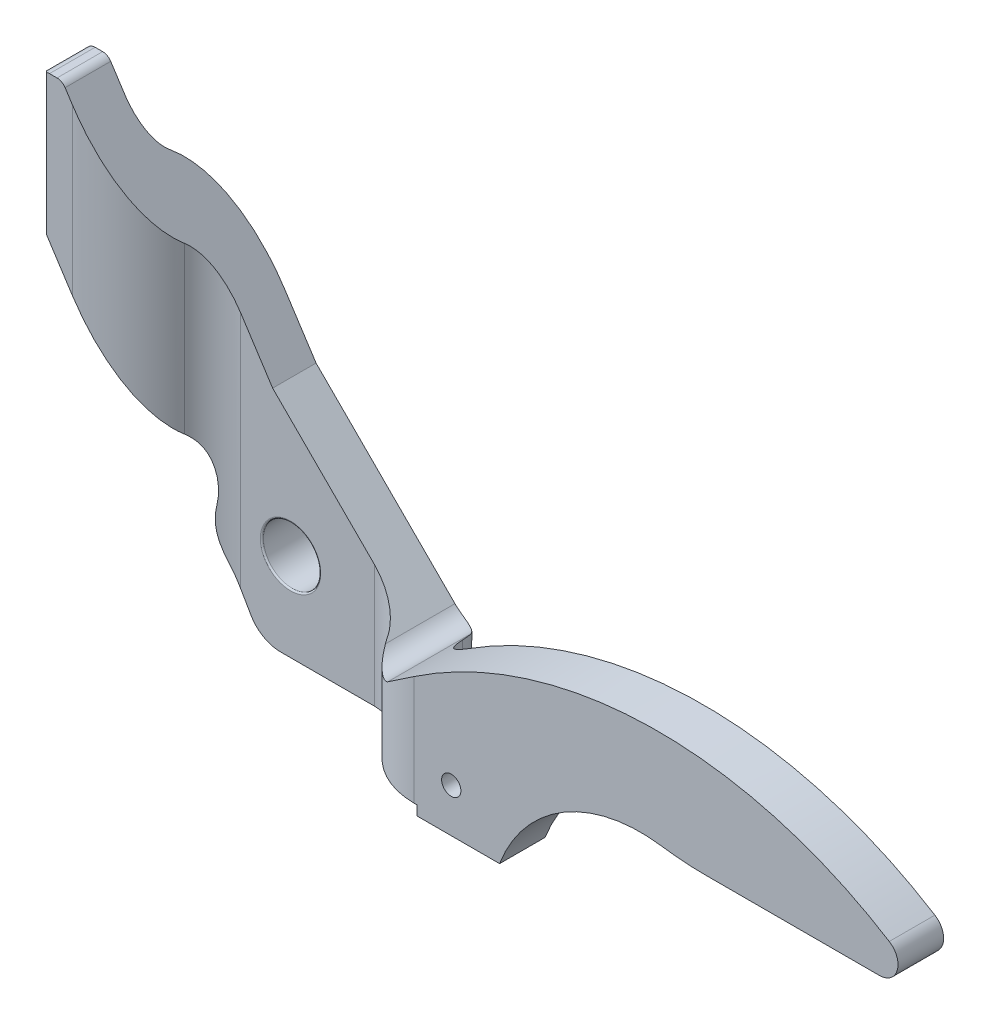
ISO-10303-21;
HEADER;
FILE_DESCRIPTION(('STEP AP214'),'2;1');
FILE_NAME('part.step','',(''),(''),'','','');
FILE_SCHEMA(('AUTOMOTIVE_DESIGN { 1 0 10303 214 1 1 1 1 }'));
ENDSEC;
DATA;
#1=APPLICATION_CONTEXT('core data for automotive mechanical design processes');
#2=APPLICATION_PROTOCOL_DEFINITION('international standard','automotive_design',2000,#1);
#3=PRODUCT_CONTEXT('',#1,'mechanical');
#4=PRODUCT('Part','Part','',(#3));
#5=PRODUCT_RELATED_PRODUCT_CATEGORY('part','',(#4));
#6=PRODUCT_DEFINITION_FORMATION('','',#4);
#7=PRODUCT_DEFINITION_CONTEXT('part definition',#1,'design');
#8=PRODUCT_DEFINITION('design','',#6,#7);
#9=PRODUCT_DEFINITION_SHAPE('','',#8);
#10=(LENGTH_UNIT() NAMED_UNIT(*) SI_UNIT(.MILLI.,.METRE.));
#11=(NAMED_UNIT(*) PLANE_ANGLE_UNIT() SI_UNIT($,.RADIAN.));
#12=(NAMED_UNIT(*) SI_UNIT($,.STERADIAN.) SOLID_ANGLE_UNIT());
#13=UNCERTAINTY_MEASURE_WITH_UNIT(LENGTH_MEASURE(1.E-05),#10,'distance_accuracy_value','');
#14=(GEOMETRIC_REPRESENTATION_CONTEXT(3) GLOBAL_UNCERTAINTY_ASSIGNED_CONTEXT((#13)) GLOBAL_UNIT_ASSIGNED_CONTEXT((#10,
#11,#12)) REPRESENTATION_CONTEXT('',''));
#15=CARTESIAN_POINT('',(0.,0.,0.));
#16=DIRECTION('',(0.,0.,1.));
#17=DIRECTION('',(1.,0.,0.));
#18=AXIS2_PLACEMENT_3D('',#15,#16,#17);
#19=CARTESIAN_POINT('',(-0.821223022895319,-4.4196,0.));
#20=DIRECTION('',(0.,0.,-1.));
#21=DIRECTION('',(-1.,0.,0.));
#22=AXIS2_PLACEMENT_3D('',#19,#20,#21);
#23=PLANE('',#22);
#24=DIRECTION('',(0.,-1.,0.));
#25=VECTOR('',#24,1.);
#26=CARTESIAN_POINT('',(-4.03281474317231,32.5421038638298,0.));
#27=LINE('',#26,#25);
#28=CARTESIAN_POINT('',(-4.03281474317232,-4.44495996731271,0.));
#29=VERTEX_POINT('',#28);
#30=CARTESIAN_POINT('',(-4.03281474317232,-4.04939875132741,0.));
#31=VERTEX_POINT('',#30);
#32=EDGE_CURVE('E281',#29,#31,#27,.F.);
#33=ORIENTED_EDGE('',*,*,#32,.T.);
#34=CARTESIAN_POINT('',(0.,0.,0.));
#35=DIRECTION('',(0.,0.,-1.));
#36=DIRECTION('',(-1.,0.,0.));
#37=AXIS2_PLACEMENT_3D('',#34,#35,#36);
#38=CIRCLE('',#37,5.715);
#39=CARTESIAN_POINT('',(-4.03281474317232,4.04939875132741,0.));
#40=VERTEX_POINT('',#39);
#41=EDGE_CURVE('E271',#40,#31,#38,.T.);
#42=ORIENTED_EDGE('',*,*,#41,.F.);
#43=CARTESIAN_POINT('',(-4.03281474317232,15.1175411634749,0.));
#44=VERTEX_POINT('',#43);
#45=EDGE_CURVE('E284',#40,#44,#27,.F.);
#46=ORIENTED_EDGE('',*,*,#45,.T.);
#47=DIRECTION('',(-0.544639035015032,0.838670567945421,0.));
#48=VECTOR('',#47,1.);
#49=CARTESIAN_POINT('',(-1.46541381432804,11.1640904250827,0.));
#50=LINE('',#49,#48);
#51=CARTESIAN_POINT('',(-1.46541381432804,11.1640904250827,0.));
#52=VERTEX_POINT('',#51);
#53=EDGE_CURVE('E589',#52,#44,#50,.T.);
#54=ORIENTED_EDGE('',*,*,#53,.F.);
#55=DIRECTION('',(-0.707106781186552,0.707106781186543,0.));
#56=VECTOR('',#55,1.);
#57=CARTESIAN_POINT('',(9.90579656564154,-0.207119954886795,0.));
#58=LINE('',#57,#56);
#59=CARTESIAN_POINT('',(9.90579656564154,-0.207119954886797,0.));
#60=VERTEX_POINT('',#59);
#61=EDGE_CURVE('E586',#60,#52,#58,.T.);
#62=ORIENTED_EDGE('',*,*,#61,.F.);
#63=CARTESIAN_POINT('',(11.3067165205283,1.1938,0.));
#64=DIRECTION('',(0.,0.,-1.));
#65=DIRECTION('',(1.,0.,0.));
#66=AXIS2_PLACEMENT_3D('',#63,#64,#65);
#67=CIRCLE('',#66,1.9812);
#68=CARTESIAN_POINT('',(9.96493725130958,-0.26386314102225,0.));
#69=VERTEX_POINT('',#68);
#70=EDGE_CURVE('E584',#69,#60,#67,.T.);
#71=ORIENTED_EDGE('',*,*,#70,.F.);
#72=DIRECTION('',(0.,1.,0.));
#73=VECTOR('',#72,1.);
#74=CARTESIAN_POINT('',(9.96493725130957,-8.001,0.));
#75=LINE('',#74,#73);
#76=CARTESIAN_POINT('',(9.96493725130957,-7.2136,0.));
#77=VERTEX_POINT('',#76);
#78=EDGE_CURVE('E600',#77,#69,#75,.T.);
#79=ORIENTED_EDGE('',*,*,#78,.F.);
#80=DIRECTION('',(1.,0.,0.));
#81=VECTOR('',#80,1.);
#82=CARTESIAN_POINT('',(15.621,-7.2136,0.));
#83=LINE('',#82,#81);
#84=CARTESIAN_POINT('',(-0.821223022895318,-7.2136,0.));
#85=VERTEX_POINT('',#84);
#86=EDGE_CURVE('E552',#85,#77,#83,.T.);
#87=ORIENTED_EDGE('',*,*,#86,.F.);
#88=CARTESIAN_POINT('',(-0.821223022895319,-4.4196,0.));
#89=DIRECTION('',(0.,0.,1.));
#90=DIRECTION('',(-1.,0.,0.));
#91=AXIS2_PLACEMENT_3D('',#88,#89,#90);
#92=CIRCLE('',#91,2.794);
#93=CARTESIAN_POINT('',(-3.24089800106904,-5.8166,0.));
#94=VERTEX_POINT('',#93);
#95=EDGE_CURVE('E548',#94,#85,#92,.T.);
#96=ORIENTED_EDGE('',*,*,#95,.F.);
#97=DIRECTION('',(0.500000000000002,-0.866025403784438,0.));
#98=VECTOR('',#97,1.);
#99=CARTESIAN_POINT('',(-4.94933518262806,-2.85750000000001,0.));
#100=LINE('',#99,#98);
#101=EDGE_CURVE('E289',#29,#94,#100,.T.);
#102=ORIENTED_EDGE('',*,*,#101,.F.);
#103=EDGE_LOOP('',(#33,#42,#46,#54,#62,#71,#79,#87,#96,#102));
#104=FACE_BOUND('',#103,.T.);
#105=ADVANCED_FACE('F37',(#104),#23,.T.);
#106=CARTESIAN_POINT('',(-4.03281474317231,32.5421038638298,6.35));
#107=DIRECTION('',(0.,1.,0.));
#108=DIRECTION('',(-1.,0.,0.));
#109=AXIS2_PLACEMENT_3D('',#106,#107,#108);
#110=CYLINDRICAL_SURFACE('',#109,6.35);
#111=DIRECTION('',(0.,1.,0.));
#112=VECTOR('',#111,1.);
#113=CARTESIAN_POINT('',(-9.77008992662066,32.5421038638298,3.62857142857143));
#114=LINE('',#113,#112);
#115=CARTESIAN_POINT('',(-9.77008992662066,23.9521702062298,3.62857142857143));
#116=VERTEX_POINT('',#115);
#117=CARTESIAN_POINT('',(-9.77008992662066,10.427616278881,3.62857142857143));
#118=VERTEX_POINT('',#117);
#119=EDGE_CURVE('E999',#116,#118,#114,.F.);
#120=ORIENTED_EDGE('',*,*,#119,.F.);
#121=CARTESIAN_POINT('',(-4.03281474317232,15.1175411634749,6.35));
#122=DIRECTION('',(-0.838670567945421,-0.544639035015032,0.));
#123=DIRECTION('',(-0.544639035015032,0.838670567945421,0.));
#124=AXIS2_PLACEMENT_3D('',#121,#122,#123);
#125=ELLIPSE('',#124,11.6590982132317,6.35);
#126=EDGE_CURVE('E290',#44,#116,#125,.F.);
#127=ORIENTED_EDGE('',*,*,#126,.F.);
#128=ORIENTED_EDGE('',*,*,#45,.F.);
#129=DIRECTION('',(0.,1.,0.));
#130=VECTOR('',#129,1.);
#131=CARTESIAN_POINT('',(-4.03281474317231,32.5421038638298,0.));
#132=LINE('',#131,#130);
#133=EDGE_CURVE('E268',#40,#31,#132,.F.);
#134=ORIENTED_EDGE('',*,*,#133,.T.);
#135=ORIENTED_EDGE('',*,*,#32,.F.);
#136=CARTESIAN_POINT('',(-4.03281474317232,-4.4449599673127,6.35));
#137=DIRECTION('',(0.866025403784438,0.500000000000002,0.));
#138=DIRECTION('',(-0.500000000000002,0.866025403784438,0.));
#139=AXIS2_PLACEMENT_3D('',#136,#137,#138);
#140=ELLIPSE('',#139,12.7,6.35);
#141=CARTESIAN_POINT('',(-4.94933518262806,-2.85750000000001,0.0664906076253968));
#142=VERTEX_POINT('',#141);
#143=EDGE_CURVE('E294',#142,#29,#140,.F.);
#144=ORIENTED_EDGE('',*,*,#143,.F.);
#145=CARTESIAN_POINT('',(-5.63304277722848,0.964393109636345,0.204939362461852));
#146=CARTESIAN_POINT('',(-5.65956609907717,0.809588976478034,0.211892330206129));
#147=CARTESIAN_POINT('',(-5.67968142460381,0.653612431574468,0.217269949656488));
#148=CARTESIAN_POINT('',(-5.70700816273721,0.340470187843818,0.224648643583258));
#149=CARTESIAN_POINT('',(-5.7142208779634,0.183304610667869,0.226650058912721));
#150=CARTESIAN_POINT('',(-5.71565737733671,-0.13054805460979,0.227051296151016));
#151=CARTESIAN_POINT('',(-5.7099259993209,-0.287234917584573,0.225463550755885));
#152=CARTESIAN_POINT('',(-5.68562339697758,-0.59953109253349,0.218858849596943));
#153=CARTESIAN_POINT('',(-5.66705241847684,-0.755140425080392,0.2138419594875));
#154=CARTESIAN_POINT('',(-5.61721995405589,-1.06422677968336,0.200787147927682));
#155=CARTESIAN_POINT('',(-5.58595485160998,-1.21770318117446,0.192748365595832));
#156=CARTESIAN_POINT('',(-5.51096454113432,-1.52150838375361,0.174316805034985));
#157=CARTESIAN_POINT('',(-5.46723350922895,-1.6718356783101,0.163922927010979));
#158=CARTESIAN_POINT('',(-5.36761866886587,-1.96833990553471,0.141666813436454));
#159=CARTESIAN_POINT('',(-5.31173147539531,-2.11451566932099,0.129804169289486));
#160=CARTESIAN_POINT('',(-5.18817750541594,-2.40176724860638,0.105674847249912));
#161=CARTESIAN_POINT('',(-5.12051051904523,-2.54284297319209,0.0934081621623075));
#162=CARTESIAN_POINT('',(-4.97219435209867,-2.82206336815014,0.0694084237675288));
#163=CARTESIAN_POINT('',(-4.89129263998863,-2.96007557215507,0.0576930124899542));
#164=CARTESIAN_POINT('',(-4.71812971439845,-3.22893905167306,0.0364867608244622));
#165=CARTESIAN_POINT('',(-4.62587004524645,-3.35979129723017,0.0269956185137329));
#166=CARTESIAN_POINT('',(-4.43041545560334,-3.61362916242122,0.0117011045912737));
#167=CARTESIAN_POINT('',(-4.3272041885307,-3.73660257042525,0.00590333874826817));
#168=CARTESIAN_POINT('',(-4.11067855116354,-3.97358776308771,-0.000446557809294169));
#169=CARTESIAN_POINT('',(-3.99735767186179,-4.08759368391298,-0.0009952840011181));
#170=CARTESIAN_POINT('',(-3.8794081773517,-4.19659590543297,0.00185330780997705));
#171=B_SPLINE_CURVE_WITH_KNOTS('',3,(#145,#146,#147,#148,#149,#150,#151,#152,#153,#154,#155,
#156,#157,#158,#159,#160,#161,#162,#163,#164,#165,#166,#167,#168,#169,#170),.UNSPECIFIED.,.F.,
.F.,(4,2,2,2,2,2,2,2,2,2,2,2,4),(0.,0.471506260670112,0.942964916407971,1.4127929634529,
1.88261201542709,2.35256501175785,2.82273792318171,3.29304192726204,3.7633543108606,
4.24399824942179,4.72457690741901,5.2058832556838,5.68750175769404),.UNSPECIFIED.);
#172=CARTESIAN_POINT('',(-5.63304277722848,0.964393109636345,0.204939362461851));
#173=VERTEX_POINT('',#172);
#174=EDGE_CURVE('E1026',#173,#142,#171,.T.);
#175=ORIENTED_EDGE('',*,*,#174,.F.);
#176=CARTESIAN_POINT('',(-6.56642108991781,5.49439888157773,0.52734262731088));
#177=CARTESIAN_POINT('',(-6.47786959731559,5.35812298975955,0.488843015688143));
#178=CARTESIAN_POINT('',(-6.39408393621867,5.21757055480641,0.454756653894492));
#179=CARTESIAN_POINT('',(-6.23705364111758,4.92922611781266,0.394246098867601));
#180=CARTESIAN_POINT('',(-6.1638026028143,4.78143858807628,0.367817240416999));
#181=CARTESIAN_POINT('',(-6.02892172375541,4.48017297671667,0.321475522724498));
#182=CARTESIAN_POINT('',(-5.96726121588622,4.32671123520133,0.301545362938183));
#183=CARTESIAN_POINT('',(-5.85594878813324,4.01488950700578,0.267066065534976));
#184=CARTESIAN_POINT('',(-5.80629848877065,3.85652886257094,0.252517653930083));
#185=CARTESIAN_POINT('',(-5.71956363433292,3.53635841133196,0.227957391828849));
#186=CARTESIAN_POINT('',(-5.68245768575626,3.37455498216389,0.217937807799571));
#187=CARTESIAN_POINT('',(-5.62101061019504,3.04836232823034,0.201736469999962));
#188=CARTESIAN_POINT('',(-5.59666904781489,2.88397319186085,0.195554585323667));
#189=CARTESIAN_POINT('',(-5.56093238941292,2.55359914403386,0.186584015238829));
#190=CARTESIAN_POINT('',(-5.54954539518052,2.3876132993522,0.183797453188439));
#191=CARTESIAN_POINT('',(-5.53983215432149,2.05523666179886,0.181416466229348));
#192=CARTESIAN_POINT('',(-5.541506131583,1.88884586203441,0.18182209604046));
#193=CARTESIAN_POINT('',(-5.55820370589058,1.55067937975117,0.185929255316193));
#194=CARTESIAN_POINT('',(-5.57371227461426,1.37892879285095,0.189750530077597));
#195=CARTESIAN_POINT('',(-5.61861778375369,1.03738809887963,0.201157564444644));
#196=CARTESIAN_POINT('',(-5.64801445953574,0.86759795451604,0.208743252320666));
#197=CARTESIAN_POINT('',(-5.72047812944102,0.531044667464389,0.228259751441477));
#198=CARTESIAN_POINT('',(-5.76355580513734,0.364283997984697,0.240193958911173));
#199=CARTESIAN_POINT('',(-5.8380950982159,0.117508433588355,0.26196865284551));
#200=CARTESIAN_POINT('',(-5.86460201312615,0.0357938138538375,0.269874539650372));
#201=CARTESIAN_POINT('',(-5.92085739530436,-0.126365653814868,0.287108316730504));
#202=CARTESIAN_POINT('',(-5.95060608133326,-0.20681041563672,0.296436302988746));
#203=CARTESIAN_POINT('',(-5.98194119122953,-0.286547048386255,0.306540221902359));
#204=B_SPLINE_CURVE_WITH_KNOTS('',3,(#176,#177,#178,#179,#180,#181,#182,#183,#184,#185,#186,
#187,#188,#189,#190,#191,#192,#193,#194,#195,#196,#197,#198,#199,#200,#201,#202,#203),
.UNSPECIFIED.,.F.,.F.,(4,2,2,2,2,2,2,2,2,2,2,2,2,4),(0.,0.500795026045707,1.00128430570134,
1.50043011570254,1.99964323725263,2.4980006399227,2.99634104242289,3.49499293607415,
3.99365337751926,4.51051268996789,5.02736215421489,5.54461614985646,5.80335312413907,
6.06210756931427),.UNSPECIFIED.);
#205=CARTESIAN_POINT('',(-6.56642108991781,5.49439888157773,0.52734262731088));
#206=VERTEX_POINT('',#205);
#207=EDGE_CURVE('E1020',#206,#173,#204,.T.);
#208=ORIENTED_EDGE('',*,*,#207,.F.);
#209=CARTESIAN_POINT('',(-4.03281474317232,1.59298723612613,6.35));
#210=DIRECTION('',(0.838670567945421,0.544639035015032,0.));
#211=DIRECTION('',(-0.544639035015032,0.838670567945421,0.));
#212=AXIS2_PLACEMENT_3D('',#209,#210,#211);
#213=ELLIPSE('',#212,11.6590982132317,6.35);
#214=EDGE_CURVE('E1017',#118,#206,#213,.F.);
#215=ORIENTED_EDGE('',*,*,#214,.F.);
#216=EDGE_LOOP('',(#120,#127,#128,#134,#135,#144,#175,#208,#215));
#217=FACE_BOUND('',#216,.T.);
#218=ADVANCED_FACE('F280',(#217),#110,.T.);
#219=CARTESIAN_POINT('',(-13.8595121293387,28.8036,8.8138));
#220=DIRECTION('',(0.,0.,-1.));
#221=DIRECTION('',(-1.,0.,0.));
#222=AXIS2_PLACEMENT_3D('',#219,#220,#221);
#223=CYLINDRICAL_SURFACE('',#222,0.7874);
#224=CARTESIAN_POINT('',(-13.8595121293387,28.8036,5.08));
#225=DIRECTION('',(0.,0.,-1.));
#226=DIRECTION('',(-1.,0.,0.));
#227=AXIS2_PLACEMENT_3D('',#224,#225,#226);
#228=CIRCLE('',#227,0.7874);
#229=CARTESIAN_POINT('',(-13.8595121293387,29.591,5.08));
#230=VERTEX_POINT('',#229);
#231=CARTESIAN_POINT('',(-13.1991429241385,29.2324487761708,5.08));
#232=VERTEX_POINT('',#231);
#233=EDGE_CURVE('E676',#230,#232,#228,.T.);
#234=ORIENTED_EDGE('',*,*,#233,.F.);
#235=DIRECTION('',(0.,0.,-1.));
#236=VECTOR('',#235,1.);
#237=CARTESIAN_POINT('',(-13.8595121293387,29.591,8.8138));
#238=LINE('',#237,#236);
#239=CARTESIAN_POINT('',(-13.8595121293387,29.591,8.8138));
#240=VERTEX_POINT('',#239);
#241=EDGE_CURVE('E395',#240,#230,#238,.T.);
#242=ORIENTED_EDGE('',*,*,#241,.F.);
#243=CARTESIAN_POINT('',(-13.8595121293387,28.8036,8.8138));
#244=DIRECTION('',(0.,0.,1.));
#245=DIRECTION('',(1.,0.,0.));
#246=AXIS2_PLACEMENT_3D('',#243,#244,#245);
#247=CIRCLE('',#246,0.7874);
#248=CARTESIAN_POINT('',(-13.1991429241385,29.2324487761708,8.8138));
#249=VERTEX_POINT('',#248);
#250=EDGE_CURVE('E575',#249,#240,#247,.T.);
#251=ORIENTED_EDGE('',*,*,#250,.F.);
#252=DIRECTION('',(0.,0.,-1.));
#253=VECTOR('',#252,1.);
#254=CARTESIAN_POINT('',(-13.1991429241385,29.2324487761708,8.8138));
#255=LINE('',#254,#253);
#256=EDGE_CURVE('E398',#249,#232,#255,.T.);
#257=ORIENTED_EDGE('',*,*,#256,.T.);
#258=EDGE_LOOP('',(#234,#242,#251,#257));
#259=FACE_BOUND('',#258,.T.);
#260=ADVANCED_FACE('F361',(#259),#223,.T.);
#261=CARTESIAN_POINT('',(-15.24,29.591,8.8138));
#262=DIRECTION('',(0.,-1.,0.));
#263=DIRECTION('',(0.,0.,-1.));
#264=AXIS2_PLACEMENT_3D('',#261,#262,#263);
#265=PLANE('',#264);
#266=DIRECTION('',(1.,0.,0.));
#267=VECTOR('',#266,1.);
#268=CARTESIAN_POINT('',(-15.24,29.591,5.08));
#269=LINE('',#268,#267);
#270=CARTESIAN_POINT('',(-14.478,29.591,5.08));
#271=VERTEX_POINT('',#270);
#272=EDGE_CURVE('E678',#271,#230,#269,.T.);
#273=ORIENTED_EDGE('',*,*,#272,.F.);
#274=DIRECTION('',(0.,0.,-1.));
#275=VECTOR('',#274,1.);
#276=CARTESIAN_POINT('',(-14.478,29.591,8.8138));
#277=LINE('',#276,#275);
#278=CARTESIAN_POINT('',(-14.478,29.591,8.8138));
#279=VERTEX_POINT('',#278);
#280=EDGE_CURVE('E434',#271,#279,#277,.F.);
#281=ORIENTED_EDGE('',*,*,#280,.T.);
#282=DIRECTION('',(-1.,0.,0.));
#283=VECTOR('',#282,1.);
#284=CARTESIAN_POINT('',(-15.24,29.591,8.8138));
#285=LINE('',#284,#283);
#286=EDGE_CURVE('E577',#240,#279,#285,.T.);
#287=ORIENTED_EDGE('',*,*,#286,.F.);
#288=ORIENTED_EDGE('',*,*,#241,.T.);
#289=EDGE_LOOP('',(#273,#281,#287,#288));
#290=FACE_BOUND('',#289,.T.);
#291=ADVANCED_FACE('F766',(#290),#265,.F.);
#292=CARTESIAN_POINT('',(-15.24,29.591,8.8138));
#293=DIRECTION('',(1.,0.,0.));
#294=DIRECTION('',(0.,1.,0.));
#295=AXIS2_PLACEMENT_3D('',#292,#293,#294);
#296=PLANE('',#295);
#297=DIRECTION('',(0.,0.,-1.));
#298=VECTOR('',#297,1.);
#299=CARTESIAN_POINT('',(-15.24,19.7910170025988,8.8138));
#300=LINE('',#299,#298);
#301=CARTESIAN_POINT('',(-15.24,19.7910170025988,5.08));
#302=VERTEX_POINT('',#301);
#303=CARTESIAN_POINT('',(-15.24,19.7910170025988,8.30579999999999));
#304=VERTEX_POINT('',#303);
#305=EDGE_CURVE('E442',#302,#304,#300,.F.);
#306=ORIENTED_EDGE('',*,*,#305,.T.);
#307=DIRECTION('',(0.,1.,0.));
#308=VECTOR('',#307,1.);
#309=CARTESIAN_POINT('',(-15.24,29.591,8.30579999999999));
#310=LINE('',#309,#308);
#311=CARTESIAN_POINT('',(-15.24,28.829,8.30579999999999));
#312=VERTEX_POINT('',#311);
#313=EDGE_CURVE('E52',#304,#312,#310,.T.);
#314=ORIENTED_EDGE('',*,*,#313,.T.);
#315=DIRECTION('',(0.,0.,-1.));
#316=VECTOR('',#315,1.);
#317=CARTESIAN_POINT('',(-15.24,28.829,8.8138));
#318=LINE('',#317,#316);
#319=CARTESIAN_POINT('',(-15.24,28.829,5.08));
#320=VERTEX_POINT('',#319);
#321=EDGE_CURVE('E432',#312,#320,#318,.T.);
#322=ORIENTED_EDGE('',*,*,#321,.T.);
#323=DIRECTION('',(0.,1.,0.));
#324=VECTOR('',#323,1.);
#325=CARTESIAN_POINT('',(-15.24,29.591,5.08));
#326=LINE('',#325,#324);
#327=EDGE_CURVE('E683',#302,#320,#326,.T.);
#328=ORIENTED_EDGE('',*,*,#327,.F.);
#329=EDGE_LOOP('',(#306,#314,#322,#328));
#330=FACE_BOUND('',#329,.T.);
#331=ADVANCED_FACE('F760',(#330),#296,.F.);
#332=CARTESIAN_POINT('',(-14.478,28.829,8.8138));
#333=DIRECTION('',(0.,0.,-1.));
#334=DIRECTION('',(-1.,0.,0.));
#335=AXIS2_PLACEMENT_3D('',#332,#333,#334);
#336=CYLINDRICAL_SURFACE('',#335,0.762);
#337=ORIENTED_EDGE('',*,*,#321,.F.);
#338=CARTESIAN_POINT('',(-14.478,28.829,9.06779999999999));
#339=DIRECTION('',(0.707106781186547,0.,-0.707106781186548));
#340=DIRECTION('',(-0.707106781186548,0.,-0.707106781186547));
#341=AXIS2_PLACEMENT_3D('',#338,#339,#340);
#342=ELLIPSE('',#341,1.0776307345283,0.762);
#343=CARTESIAN_POINT('',(-14.732,29.5474204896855,8.8138));
#344=VERTEX_POINT('',#343);
#345=EDGE_CURVE('E1050',#312,#344,#342,.T.);
#346=ORIENTED_EDGE('',*,*,#345,.T.);
#347=CARTESIAN_POINT('',(-14.478,28.829,8.8138));
#348=DIRECTION('',(0.,0.,-1.));
#349=DIRECTION('',(-1.,0.,0.));
#350=AXIS2_PLACEMENT_3D('',#347,#348,#349);
#351=CIRCLE('',#350,0.762);
#352=EDGE_CURVE('E436',#279,#344,#351,.F.);
#353=ORIENTED_EDGE('',*,*,#352,.F.);
#354=ORIENTED_EDGE('',*,*,#280,.F.);
#355=CARTESIAN_POINT('',(-14.478,28.829,5.08));
#356=DIRECTION('',(0.,0.,-1.));
#357=DIRECTION('',(-1.,0.,0.));
#358=AXIS2_PLACEMENT_3D('',#355,#356,#357);
#359=CIRCLE('',#358,0.762);
#360=EDGE_CURVE('E680',#271,#320,#359,.F.);
#361=ORIENTED_EDGE('',*,*,#360,.T.);
#362=EDGE_LOOP('',(#337,#346,#353,#354,#361));
#363=FACE_BOUND('',#362,.T.);
#364=ADVANCED_FACE('F765',(#363),#336,.T.);
#365=CARTESIAN_POINT('',(-12.065,19.7910170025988,8.8138));
#366=DIRECTION('',(0.,0.,-1.));
#367=DIRECTION('',(-1.,0.,0.));
#368=AXIS2_PLACEMENT_3D('',#365,#366,#367);
#369=CYLINDRICAL_SURFACE('',#368,3.175);
#370=CARTESIAN_POINT('',(-12.065,19.7910170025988,8.8138));
#371=DIRECTION('',(0.,0.,-1.));
#372=DIRECTION('',(-1.,0.,0.));
#373=AXIS2_PLACEMENT_3D('',#370,#371,#372);
#374=CIRCLE('',#373,3.175);
#375=CARTESIAN_POINT('',(-14.732,18.068305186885,8.8138));
#376=VERTEX_POINT('',#375);
#377=CARTESIAN_POINT('',(-14.7277790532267,18.0617880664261,8.8138));
#378=VERTEX_POINT('',#377);
#379=EDGE_CURVE('E444',#376,#378,#374,.F.);
#380=ORIENTED_EDGE('',*,*,#379,.F.);
#381=CARTESIAN_POINT('',(-12.065,19.7910170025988,11.4808));
#382=DIRECTION('',(0.707106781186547,0.,-0.707106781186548));
#383=DIRECTION('',(-0.707106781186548,0.,-0.707106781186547));
#384=AXIS2_PLACEMENT_3D('',#381,#382,#383);
#385=ELLIPSE('',#384,4.49012806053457,3.175);
#386=EDGE_CURVE('E60',#376,#304,#385,.T.);
#387=ORIENTED_EDGE('',*,*,#386,.T.);
#388=ORIENTED_EDGE('',*,*,#305,.F.);
#389=CARTESIAN_POINT('',(-12.065,19.7910170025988,5.08));
#390=DIRECTION('',(0.,0.,-1.));
#391=DIRECTION('',(-1.,0.,0.));
#392=AXIS2_PLACEMENT_3D('',#389,#390,#391);
#393=CIRCLE('',#392,3.175);
#394=CARTESIAN_POINT('',(-14.7277790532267,18.0617880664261,5.08));
#395=VERTEX_POINT('',#394);
#396=EDGE_CURVE('E1011',#302,#395,#393,.F.);
#397=ORIENTED_EDGE('',*,*,#396,.T.);
#398=DIRECTION('',(0.,0.,-1.));
#399=VECTOR('',#398,1.);
#400=CARTESIAN_POINT('',(-14.7277790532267,18.0617880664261,8.8138));
#401=LINE('',#400,#399);
#402=EDGE_CURVE('E439',#378,#395,#401,.T.);
#403=ORIENTED_EDGE('',*,*,#402,.F.);
#404=EDGE_LOOP('',(#380,#387,#388,#397,#403));
#405=FACE_BOUND('',#404,.T.);
#406=ADVANCED_FACE('F777',(#405),#369,.T.);
#407=CARTESIAN_POINT('',(15.621,-7.2136,8.8138));
#408=DIRECTION('',(0.,1.,0.));
#409=DIRECTION('',(-1.,0.,0.));
#410=AXIS2_PLACEMENT_3D('',#407,#408,#409);
#411=PLANE('',#410);
#412=CARTESIAN_POINT('',(9.96493725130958,-7.2136,3.175));
#413=DIRECTION('',(0.,1.,0.));
#414=DIRECTION('',(-1.,0.,0.));
#415=AXIS2_PLACEMENT_3D('',#412,#413,#414);
#416=CIRCLE('',#415,3.175);
#417=CARTESIAN_POINT('',(13.0757892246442,-7.2136,2.54));
#418=VERTEX_POINT('',#417);
#419=EDGE_CURVE('E498',#77,#418,#416,.F.);
#420=ORIENTED_EDGE('',*,*,#419,.T.);
#421=CARTESIAN_POINT('',(16.1866411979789,-7.2136,1.905));
#422=DIRECTION('',(0.,1.,0.));
#423=DIRECTION('',(-1.,0.,0.));
#424=AXIS2_PLACEMENT_3D('',#421,#422,#423);
#425=CIRCLE('',#424,3.175);
#426=CARTESIAN_POINT('',(15.621,-7.2136,5.02920790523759));
#427=VERTEX_POINT('',#426);
#428=EDGE_CURVE('E634',#418,#427,#425,.T.);
#429=ORIENTED_EDGE('',*,*,#428,.T.);
#430=DIRECTION('',(0.,0.,-1.));
#431=VECTOR('',#430,1.);
#432=CARTESIAN_POINT('',(15.621,-7.2136,8.8138));
#433=LINE('',#432,#431);
#434=CARTESIAN_POINT('',(15.621,-7.2136,8.8138));
#435=VERTEX_POINT('',#434);
#436=EDGE_CURVE('E427',#435,#427,#433,.T.);
#437=ORIENTED_EDGE('',*,*,#436,.F.);
#438=DIRECTION('',(1.,0.,0.));
#439=VECTOR('',#438,1.);
#440=CARTESIAN_POINT('',(15.621,-7.2136,8.8138));
#441=LINE('',#440,#439);
#442=CARTESIAN_POINT('',(15.3736696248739,-7.2136,8.8138));
#443=VERTEX_POINT('',#442);
#444=EDGE_CURVE('E556',#443,#435,#441,.T.);
#445=ORIENTED_EDGE('',*,*,#444,.F.);
#446=CARTESIAN_POINT('',(15.3736696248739,-7.2136,2.4638));
#447=DIRECTION('',(0.,1.,0.));
#448=DIRECTION('',(-1.,0.,0.));
#449=AXIS2_PLACEMENT_3D('',#446,#447,#448);
#450=CIRCLE('',#449,6.35);
#451=CARTESIAN_POINT('',(9.69655654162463,-7.2136,5.3086));
#452=VERTEX_POINT('',#451);
#453=EDGE_CURVE('E521',#443,#452,#450,.F.);
#454=ORIENTED_EDGE('',*,*,#453,.T.);
#455=CARTESIAN_POINT('',(6.858,-7.2136,6.731));
#456=DIRECTION('',(0.,1.,0.));
#457=DIRECTION('',(-1.,0.,0.));
#458=AXIS2_PLACEMENT_3D('',#455,#456,#457);
#459=CIRCLE('',#458,3.175);
#460=CARTESIAN_POINT('',(6.858,-7.2136,3.556));
#461=VERTEX_POINT('',#460);
#462=EDGE_CURVE('E549',#452,#461,#459,.T.);
#463=ORIENTED_EDGE('',*,*,#462,.T.);
#464=DIRECTION('',(-1.,0.,0.));
#465=VECTOR('',#464,1.);
#466=CARTESIAN_POINT('',(15.621,-7.2136,3.556));
#467=LINE('',#466,#465);
#468=CARTESIAN_POINT('',(-0.821223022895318,-7.2136,3.556));
#469=VERTEX_POINT('',#468);
#470=EDGE_CURVE('E606',#461,#469,#467,.T.);
#471=ORIENTED_EDGE('',*,*,#470,.T.);
#472=DIRECTION('',(0.,0.,-1.));
#473=VECTOR('',#472,1.);
#474=CARTESIAN_POINT('',(-0.821223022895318,-7.2136,8.8138));
#475=LINE('',#474,#473);
#476=EDGE_CURVE('E430',#469,#85,#475,.T.);
#477=ORIENTED_EDGE('',*,*,#476,.T.);
#478=ORIENTED_EDGE('',*,*,#86,.T.);
#479=EDGE_LOOP('',(#420,#429,#437,#445,#454,#463,#471,#477,#478));
#480=FACE_BOUND('',#479,.T.);
#481=ADVANCED_FACE('F603',(#480),#411,.F.);
#482=CARTESIAN_POINT('',(-0.821223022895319,-4.4196,8.8138));
#483=DIRECTION('',(0.,0.,-1.));
#484=DIRECTION('',(-1.,0.,0.));
#485=AXIS2_PLACEMENT_3D('',#482,#483,#484);
#486=PLANE('',#485);
#487=ORIENTED_EDGE('',*,*,#352,.T.);
#488=DIRECTION('',(0.,-1.,0.));
#489=VECTOR('',#488,1.);
#490=CARTESIAN_POINT('',(-14.732,-4.41960000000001,8.8138));
#491=LINE('',#490,#489);
#492=EDGE_CURVE('E1044',#344,#376,#491,.T.);
#493=ORIENTED_EDGE('',*,*,#492,.T.);
#494=ORIENTED_EDGE('',*,*,#379,.T.);
#495=DIRECTION('',(0.544639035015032,-0.838670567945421,0.));
#496=VECTOR('',#495,1.);
#497=CARTESIAN_POINT('',(-6.56642108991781,5.49439888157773,8.8138));
#498=LINE('',#497,#496);
#499=CARTESIAN_POINT('',(-12.6053656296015,14.7935579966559,8.8138));
#500=VERTEX_POINT('',#499);
#501=EDGE_CURVE('E390',#378,#500,#498,.T.);
#502=ORIENTED_EDGE('',*,*,#501,.T.);
#503=DIRECTION('',(0.,-1.,0.));
#504=VECTOR('',#503,1.);
#505=CARTESIAN_POINT('',(-12.6053656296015,-4.4196,8.8138));
#506=LINE('',#505,#504);
#507=CARTESIAN_POINT('',(-12.6053656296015,28.3181119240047,8.8138));
#508=VERTEX_POINT('',#507);
#509=EDGE_CURVE('E292',#500,#508,#506,.F.);
#510=ORIENTED_EDGE('',*,*,#509,.T.);
#511=DIRECTION('',(-0.544639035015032,0.838670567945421,0.));
#512=VECTOR('',#511,1.);
#513=CARTESIAN_POINT('',(-1.46541381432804,11.1640904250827,8.8138));
#514=LINE('',#513,#512);
#515=EDGE_CURVE('E573',#508,#249,#514,.T.);
#516=ORIENTED_EDGE('',*,*,#515,.T.);
#517=ORIENTED_EDGE('',*,*,#250,.T.);
#518=ORIENTED_EDGE('',*,*,#286,.T.);
#519=EDGE_LOOP('',(#487,#493,#494,#502,#510,#516,#517,#518));
#520=FACE_BOUND('',#519,.T.);
#521=ADVANCED_FACE('F792',(#520),#486,.F.);
#522=CARTESIAN_POINT('',(9.90579656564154,-0.207119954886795,8.8138));
#523=DIRECTION('',(-0.707106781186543,-0.707106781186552,0.));
#524=DIRECTION('',(0.707106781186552,-0.707106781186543,0.));
#525=AXIS2_PLACEMENT_3D('',#522,#523,#524);
#526=PLANE('',#525);
#527=DIRECTION('',(0.,0.,-1.));
#528=VECTOR('',#527,1.);
#529=CARTESIAN_POINT('',(-1.46541381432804,11.1640904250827,8.8138));
#530=LINE('',#529,#528);
#531=CARTESIAN_POINT('',(-1.46541381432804,11.1640904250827,3.556));
#532=VERTEX_POINT('',#531);
#533=EDGE_CURVE('E401',#532,#52,#530,.T.);
#534=ORIENTED_EDGE('',*,*,#533,.F.);
#535=DIRECTION('',(0.707106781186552,-0.707106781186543,0.));
#536=VECTOR('',#535,1.);
#537=CARTESIAN_POINT('',(9.90579656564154,-0.207119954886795,3.556));
#538=LINE('',#537,#536);
#539=CARTESIAN_POINT('',(6.858,2.8406766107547,3.556));
#540=VERTEX_POINT('',#539);
#541=EDGE_CURVE('E613',#532,#540,#538,.T.);
#542=ORIENTED_EDGE('',*,*,#541,.T.);
#543=CARTESIAN_POINT('',(6.858,2.8406766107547,6.731));
#544=DIRECTION('',(-0.707106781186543,-0.707106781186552,0.));
#545=DIRECTION('',(-0.707106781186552,0.707106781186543,0.));
#546=AXIS2_PLACEMENT_3D('',#543,#544,#545);
#547=ELLIPSE('',#546,4.49012806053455,3.175);
#548=CARTESIAN_POINT('',(9.69655654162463,0.00212006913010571,5.3086));
#549=VERTEX_POINT('',#548);
#550=EDGE_CURVE('E449',#540,#549,#547,.T.);
#551=ORIENTED_EDGE('',*,*,#550,.T.);
#552=CARTESIAN_POINT('',(15.3736696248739,-5.67499301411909,2.4638));
#553=DIRECTION('',(-0.707106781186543,-0.707106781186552,0.));
#554=DIRECTION('',(-0.707106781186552,0.707106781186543,0.));
#555=AXIS2_PLACEMENT_3D('',#552,#553,#554);
#556=ELLIPSE('',#555,8.9802561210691,6.35);
#557=CARTESIAN_POINT('',(9.90579656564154,-0.207119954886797,5.69255582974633));
#558=VERTEX_POINT('',#557);
#559=EDGE_CURVE('E446',#549,#558,#556,.F.);
#560=ORIENTED_EDGE('',*,*,#559,.T.);
#561=DIRECTION('',(0.,0.,-1.));
#562=VECTOR('',#561,1.);
#563=CARTESIAN_POINT('',(9.90579656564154,-0.207119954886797,8.8138));
#564=LINE('',#563,#562);
#565=EDGE_CURVE('E403',#558,#60,#564,.T.);
#566=ORIENTED_EDGE('',*,*,#565,.T.);
#567=ORIENTED_EDGE('',*,*,#61,.T.);
#568=EDGE_LOOP('',(#534,#542,#551,#560,#566,#567));
#569=FACE_BOUND('',#568,.T.);
#570=ADVANCED_FACE('F798',(#569),#526,.F.);
#571=CARTESIAN_POINT('',(53.467,1.143,8.8138));
#572=DIRECTION('',(0.,0.,1.));
#573=DIRECTION('',(1.,0.,0.));
#574=AXIS2_PLACEMENT_3D('',#571,#572,#573);
#575=CIRCLE('',#574,1.52399999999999);
#576=CARTESIAN_POINT('',(53.467,-0.381,8.8138));
#577=VERTEX_POINT('',#576);
#578=CARTESIAN_POINT('',(54.2757273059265,2.43471829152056,8.8138));
#579=VERTEX_POINT('',#578);
#580=EDGE_CURVE('E568',#577,#579,#575,.T.);
#581=ORIENTED_EDGE('',*,*,#580,.T.);
#582=CARTESIAN_POINT('',(35.3379656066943,-27.8131205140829,8.8138));
#583=DIRECTION('',(0.,0.,1.));
#584=DIRECTION('',(-1.,0.,0.));
#585=AXIS2_PLACEMENT_3D('',#582,#583,#584);
#586=CIRCLE('',#585,35.6871205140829);
#587=CARTESIAN_POINT('',(15.3736696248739,1.76723540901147,8.8138));
#588=VERTEX_POINT('',#587);
#589=EDGE_CURVE('E570',#579,#588,#586,.T.);
#590=ORIENTED_EDGE('',*,*,#589,.T.);
#591=DIRECTION('',(0.,1.,0.));
#592=VECTOR('',#591,1.);
#593=CARTESIAN_POINT('',(15.3736696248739,-8.001,8.8138));
#594=LINE('',#593,#592);
#595=EDGE_CURVE('E984',#443,#588,#594,.T.);
#596=ORIENTED_EDGE('',*,*,#595,.F.);
#597=ORIENTED_EDGE('',*,*,#444,.T.);
#598=DIRECTION('',(0.,-1.,0.));
#599=VECTOR('',#598,1.);
#600=CARTESIAN_POINT('',(15.621,-7.2136,8.8138));
#601=LINE('',#600,#599);
#602=CARTESIAN_POINT('',(15.621,-8.001,8.8138));
#603=VERTEX_POINT('',#602);
#604=EDGE_CURVE('E558',#435,#603,#601,.T.);
#605=ORIENTED_EDGE('',*,*,#604,.T.);
#606=DIRECTION('',(1.,0.,0.));
#607=VECTOR('',#606,1.);
#608=CARTESIAN_POINT('',(15.621,-8.001,8.8138));
#609=LINE('',#608,#607);
#610=CARTESIAN_POINT('',(22.3715550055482,-8.001,8.8138));
#611=VERTEX_POINT('',#610);
#612=EDGE_CURVE('E560',#603,#611,#609,.T.);
#613=ORIENTED_EDGE('',*,*,#612,.T.);
#614=CARTESIAN_POINT('',(33.909,-12.319,8.8138));
#615=DIRECTION('',(0.,0.,-1.));
#616=DIRECTION('',(-1.,0.,0.));
#617=AXIS2_PLACEMENT_3D('',#614,#615,#616);
#618=CIRCLE('',#617,12.319);
#619=CARTESIAN_POINT('',(35.6643619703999,-0.125704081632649,8.8138));
#620=VERTEX_POINT('',#619);
#621=EDGE_CURVE('E562',#611,#620,#618,.T.);
#622=ORIENTED_EDGE('',*,*,#621,.T.);
#623=CARTESIAN_POINT('',(39.229375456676,24.638,8.8138));
#624=DIRECTION('',(0.,0.,1.));
#625=DIRECTION('',(1.,0.,0.));
#626=AXIS2_PLACEMENT_3D('',#623,#624,#625);
#627=CIRCLE('',#626,25.019);
#628=CARTESIAN_POINT('',(39.229375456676,-0.380999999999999,8.8138));
#629=VERTEX_POINT('',#628);
#630=EDGE_CURVE('E564',#620,#629,#627,.T.);
#631=ORIENTED_EDGE('',*,*,#630,.T.);
#632=DIRECTION('',(1.,0.,0.));
#633=VECTOR('',#632,1.);
#634=CARTESIAN_POINT('',(39.229375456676,-0.380999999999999,8.8138));
#635=LINE('',#634,#633);
#636=EDGE_CURVE('E566',#629,#577,#635,.T.);
#637=ORIENTED_EDGE('',*,*,#636,.T.);
#638=EDGE_LOOP('',(#581,#590,#596,#597,#605,#613,#622,#631,#637));
#639=FACE_BOUND('',#638,.T.);
#640=CARTESIAN_POINT('',(18.415,-4.4196,8.8138));
#641=DIRECTION('',(0.,0.,1.));
#642=DIRECTION('',(1.,0.,0.));
#643=AXIS2_PLACEMENT_3D('',#640,#641,#642);
#644=CIRCLE('',#643,0.787400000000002);
#645=CARTESIAN_POINT('',(19.2024,-4.4196,8.8138));
#646=VERTEX_POINT('',#645);
#647=EDGE_CURVE('E546',#646,#646,#644,.T.);
#648=ORIENTED_EDGE('',*,*,#647,.F.);
#649=EDGE_LOOP('',(#648));
#650=FACE_BOUND('',#649,.T.);
#651=ADVANCED_FACE('F363',(#639,#650),#486,.F.);
#652=CARTESIAN_POINT('',(-0.821223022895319,-4.4196,8.8138));
#653=DIRECTION('',(0.,0.,-1.));
#654=DIRECTION('',(-1.,0.,0.));
#655=AXIS2_PLACEMENT_3D('',#652,#653,#654);
#656=CYLINDRICAL_SURFACE('',#655,2.794);
#657=ORIENTED_EDGE('',*,*,#476,.F.);
#658=CARTESIAN_POINT('',(-0.821223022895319,-4.4196,3.556));
#659=DIRECTION('',(0.,0.,-1.));
#660=DIRECTION('',(-1.,0.,0.));
#661=AXIS2_PLACEMENT_3D('',#658,#659,#660);
#662=CIRCLE('',#661,2.794);
#663=CARTESIAN_POINT('',(-3.24089800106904,-5.8166,3.556));
#664=VERTEX_POINT('',#663);
#665=EDGE_CURVE('E596',#469,#664,#662,.T.);
#666=ORIENTED_EDGE('',*,*,#665,.T.);
#667=DIRECTION('',(0.,0.,-1.));
#668=VECTOR('',#667,1.);
#669=CARTESIAN_POINT('',(-3.24089800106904,-5.8166,8.8138));
#670=LINE('',#669,#668);
#671=EDGE_CURVE('E384',#664,#94,#670,.T.);
#672=ORIENTED_EDGE('',*,*,#671,.T.);
#673=ORIENTED_EDGE('',*,*,#95,.T.);
#674=EDGE_LOOP('',(#657,#666,#672,#673));
#675=FACE_BOUND('',#674,.T.);
#676=ADVANCED_FACE('F595',(#675),#656,.T.);
#677=CARTESIAN_POINT('',(15.621,-7.2136,8.8138));
#678=DIRECTION('',(1.,0.,0.));
#679=DIRECTION('',(0.,0.,-1.));
#680=AXIS2_PLACEMENT_3D('',#677,#678,#679);
#681=PLANE('',#680);
#682=ORIENTED_EDGE('',*,*,#436,.T.);
#683=DIRECTION('',(0.,1.,0.));
#684=VECTOR('',#683,1.);
#685=CARTESIAN_POINT('',(15.621,-8.001,5.02920790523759));
#686=LINE('',#685,#684);
#687=CARTESIAN_POINT('',(15.621,-8.001,5.02920790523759));
#688=VERTEX_POINT('',#687);
#689=EDGE_CURVE('E989',#427,#688,#686,.F.);
#690=ORIENTED_EDGE('',*,*,#689,.T.);
#691=DIRECTION('',(0.,0.,-1.));
#692=VECTOR('',#691,1.);
#693=CARTESIAN_POINT('',(15.621,-8.001,8.8138));
#694=LINE('',#693,#692);
#695=EDGE_CURVE('E424',#603,#688,#694,.T.);
#696=ORIENTED_EDGE('',*,*,#695,.F.);
#697=ORIENTED_EDGE('',*,*,#604,.F.);
#698=EDGE_LOOP('',(#682,#690,#696,#697));
#699=FACE_BOUND('',#698,.T.);
#700=ADVANCED_FACE('F889',(#699),#681,.F.);
#701=CARTESIAN_POINT('',(15.621,-8.001,8.8138));
#702=DIRECTION('',(0.,1.,0.));
#703=DIRECTION('',(0.,0.,1.));
#704=AXIS2_PLACEMENT_3D('',#701,#702,#703);
#705=PLANE('',#704);
#706=CARTESIAN_POINT('',(16.1866411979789,-8.001,1.905));
#707=DIRECTION('',(0.,1.,0.));
#708=DIRECTION('',(0.,0.,-1.));
#709=AXIS2_PLACEMENT_3D('',#706,#707,#708);
#710=CIRCLE('',#709,3.175);
#711=CARTESIAN_POINT('',(16.1866411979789,-8.001,5.08));
#712=VERTEX_POINT('',#711);
#713=EDGE_CURVE('E670',#688,#712,#710,.T.);
#714=ORIENTED_EDGE('',*,*,#713,.T.);
#715=DIRECTION('',(1.,0.,0.));
#716=VECTOR('',#715,1.);
#717=CARTESIAN_POINT('',(54.991,-8.001,5.08));
#718=LINE('',#717,#716);
#719=CARTESIAN_POINT('',(22.3715550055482,-8.001,5.08));
#720=VERTEX_POINT('',#719);
#721=EDGE_CURVE('E637',#712,#720,#718,.T.);
#722=ORIENTED_EDGE('',*,*,#721,.T.);
#723=DIRECTION('',(0.,0.,-1.));
#724=VECTOR('',#723,1.);
#725=CARTESIAN_POINT('',(22.3715550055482,-8.001,8.8138));
#726=LINE('',#725,#724);
#727=EDGE_CURVE('E421',#611,#720,#726,.T.);
#728=ORIENTED_EDGE('',*,*,#727,.F.);
#729=ORIENTED_EDGE('',*,*,#612,.F.);
#730=ORIENTED_EDGE('',*,*,#695,.T.);
#731=EDGE_LOOP('',(#714,#722,#728,#729,#730));
#732=FACE_BOUND('',#731,.T.);
#733=ADVANCED_FACE('F669',(#732),#705,.F.);
#734=CARTESIAN_POINT('',(33.909,-12.319,8.8138));
#735=DIRECTION('',(0.,0.,-1.));
#736=DIRECTION('',(-1.,0.,0.));
#737=AXIS2_PLACEMENT_3D('',#734,#735,#736);
#738=CYLINDRICAL_SURFACE('',#737,12.319);
#739=ORIENTED_EDGE('',*,*,#727,.T.);
#740=CARTESIAN_POINT('',(33.909,-12.319,5.08));
#741=DIRECTION('',(0.,0.,1.));
#742=DIRECTION('',(1.,0.,0.));
#743=AXIS2_PLACEMENT_3D('',#740,#741,#742);
#744=CIRCLE('',#743,12.319);
#745=CARTESIAN_POINT('',(35.6643619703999,-0.125704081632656,5.08));
#746=VERTEX_POINT('',#745);
#747=EDGE_CURVE('E499',#720,#746,#744,.F.);
#748=ORIENTED_EDGE('',*,*,#747,.T.);
#749=DIRECTION('',(0.,0.,-1.));
#750=VECTOR('',#749,1.);
#751=CARTESIAN_POINT('',(35.6643619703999,-0.125704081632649,8.8138));
#752=LINE('',#751,#750);
#753=EDGE_CURVE('E418',#620,#746,#752,.T.);
#754=ORIENTED_EDGE('',*,*,#753,.F.);
#755=ORIENTED_EDGE('',*,*,#621,.F.);
#756=EDGE_LOOP('',(#739,#748,#754,#755));
#757=FACE_BOUND('',#756,.T.);
#758=ADVANCED_FACE('F653',(#757),#738,.F.);
#759=CARTESIAN_POINT('',(39.229375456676,24.638,8.8138));
#760=DIRECTION('',(0.,0.,-1.));
#761=DIRECTION('',(-1.,0.,0.));
#762=AXIS2_PLACEMENT_3D('',#759,#760,#761);
#763=CYLINDRICAL_SURFACE('',#762,25.019);
#764=ORIENTED_EDGE('',*,*,#753,.T.);
#765=CARTESIAN_POINT('',(39.229375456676,24.638,5.08));
#766=DIRECTION('',(0.,0.,1.));
#767=DIRECTION('',(1.,0.,0.));
#768=AXIS2_PLACEMENT_3D('',#765,#766,#767);
#769=CIRCLE('',#768,25.019);
#770=CARTESIAN_POINT('',(39.229375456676,-0.380999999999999,5.08));
#771=VERTEX_POINT('',#770);
#772=EDGE_CURVE('E646',#746,#771,#769,.T.);
#773=ORIENTED_EDGE('',*,*,#772,.T.);
#774=DIRECTION('',(0.,0.,-1.));
#775=VECTOR('',#774,1.);
#776=CARTESIAN_POINT('',(39.229375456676,-0.380999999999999,8.8138));
#777=LINE('',#776,#775);
#778=EDGE_CURVE('E415',#629,#771,#777,.T.);
#779=ORIENTED_EDGE('',*,*,#778,.F.);
#780=ORIENTED_EDGE('',*,*,#630,.F.);
#781=EDGE_LOOP('',(#764,#773,#779,#780));
#782=FACE_BOUND('',#781,.T.);
#783=ADVANCED_FACE('F660',(#782),#763,.T.);
#784=CARTESIAN_POINT('',(39.229375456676,-0.380999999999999,8.8138));
#785=DIRECTION('',(0.,1.,0.));
#786=DIRECTION('',(-1.,0.,0.));
#787=AXIS2_PLACEMENT_3D('',#784,#785,#786);
#788=PLANE('',#787);
#789=ORIENTED_EDGE('',*,*,#778,.T.);
#790=DIRECTION('',(1.,0.,0.));
#791=VECTOR('',#790,1.);
#792=CARTESIAN_POINT('',(39.229375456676,-0.380999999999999,5.08));
#793=LINE('',#792,#791);
#794=CARTESIAN_POINT('',(53.467,-0.380999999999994,5.08));
#795=VERTEX_POINT('',#794);
#796=EDGE_CURVE('E644',#771,#795,#793,.T.);
#797=ORIENTED_EDGE('',*,*,#796,.T.);
#798=DIRECTION('',(0.,0.,-1.));
#799=VECTOR('',#798,1.);
#800=CARTESIAN_POINT('',(53.467,-0.381,8.8138));
#801=LINE('',#800,#799);
#802=EDGE_CURVE('E412',#577,#795,#801,.T.);
#803=ORIENTED_EDGE('',*,*,#802,.F.);
#804=ORIENTED_EDGE('',*,*,#636,.F.);
#805=EDGE_LOOP('',(#789,#797,#803,#804));
#806=FACE_BOUND('',#805,.T.);
#807=ADVANCED_FACE('F860',(#806),#788,.F.);
#808=CARTESIAN_POINT('',(53.467,1.143,8.8138));
#809=DIRECTION('',(0.,0.,-1.));
#810=DIRECTION('',(-1.,0.,0.));
#811=AXIS2_PLACEMENT_3D('',#808,#809,#810);
#812=CYLINDRICAL_SURFACE('',#811,1.52399999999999);
#813=CARTESIAN_POINT('',(53.467,1.143,5.08));
#814=DIRECTION('',(0.,0.,1.));
#815=DIRECTION('',(1.,0.,0.));
#816=AXIS2_PLACEMENT_3D('',#813,#814,#815);
#817=CIRCLE('',#816,1.52399999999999);
#818=CARTESIAN_POINT('',(54.2757273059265,2.43471829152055,5.08));
#819=VERTEX_POINT('',#818);
#820=EDGE_CURVE('E642',#795,#819,#817,.T.);
#821=ORIENTED_EDGE('',*,*,#820,.T.);
#822=DIRECTION('',(0.,0.,-1.));
#823=VECTOR('',#822,1.);
#824=CARTESIAN_POINT('',(54.2757273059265,2.43471829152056,8.8138));
#825=LINE('',#824,#823);
#826=EDGE_CURVE('E409',#579,#819,#825,.T.);
#827=ORIENTED_EDGE('',*,*,#826,.F.);
#828=ORIENTED_EDGE('',*,*,#580,.F.);
#829=ORIENTED_EDGE('',*,*,#802,.T.);
#830=EDGE_LOOP('',(#821,#827,#828,#829));
#831=FACE_BOUND('',#830,.T.);
#832=ADVANCED_FACE('F506',(#831),#812,.T.);
#833=CARTESIAN_POINT('',(35.3379656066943,-27.8131205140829,8.8138));
#834=DIRECTION('',(0.,0.,-1.));
#835=DIRECTION('',(-1.,0.,0.));
#836=AXIS2_PLACEMENT_3D('',#833,#834,#835);
#837=CYLINDRICAL_SURFACE('',#836,35.6871205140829);
#838=ORIENTED_EDGE('',*,*,#826,.T.);
#839=CARTESIAN_POINT('',(35.3379656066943,-27.8131205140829,5.08));
#840=DIRECTION('',(0.,0.,1.));
#841=DIRECTION('',(1.,0.,0.));
#842=AXIS2_PLACEMENT_3D('',#839,#840,#841);
#843=CIRCLE('',#842,35.6871205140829);
#844=CARTESIAN_POINT('',(16.1866411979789,2.29995544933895,5.08));
#845=VERTEX_POINT('',#844);
#846=EDGE_CURVE('E456',#819,#845,#843,.T.);
#847=ORIENTED_EDGE('',*,*,#846,.T.);
#848=CARTESIAN_POINT('',(16.1866411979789,2.29995544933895,5.08));
#849=CARTESIAN_POINT('',(16.072901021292,2.2276286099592,5.07999235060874));
#850=CARTESIAN_POINT('',(15.9595964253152,2.15465465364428,5.07388815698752));
#851=CARTESIAN_POINT('',(15.7346989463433,2.00801925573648,5.04970643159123));
#852=CARTESIAN_POINT('',(15.6231062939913,1.93435772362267,5.03162730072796));
#853=CARTESIAN_POINT('',(15.4018176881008,1.78651498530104,4.98356649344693));
#854=CARTESIAN_POINT('',(15.2921378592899,1.71233339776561,4.95351144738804));
#855=CARTESIAN_POINT('',(15.0762864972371,1.56462729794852,4.88168931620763));
#856=CARTESIAN_POINT('',(14.9701146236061,1.4911027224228,4.839923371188));
#857=CARTESIAN_POINT('',(14.6715509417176,1.28199930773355,4.70337166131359));
#858=CARTESIAN_POINT('',(14.4844235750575,1.14802670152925,4.59405421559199));
#859=CARTESIAN_POINT('',(14.1320660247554,0.891022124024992,4.33541923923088));
#860=CARTESIAN_POINT('',(13.9667790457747,0.767962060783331,4.18620863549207));
#861=CARTESIAN_POINT('',(13.7108284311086,0.574467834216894,3.89903034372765));
#862=CARTESIAN_POINT('',(13.6126075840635,0.499281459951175,3.77097056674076));
#863=CARTESIAN_POINT('',(13.4346308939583,0.36181638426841,3.49673920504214));
#864=CARTESIAN_POINT('',(13.3548180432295,0.299497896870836,3.35062574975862));
#865=CARTESIAN_POINT('',(13.2403702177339,0.209554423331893,3.09362032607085));
#866=CARTESIAN_POINT('',(13.1995278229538,0.177275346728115,2.98709506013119));
#867=CARTESIAN_POINT('',(13.1289395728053,0.121296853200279,2.76782454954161));
#868=CARTESIAN_POINT('',(13.0992360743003,0.0976301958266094,2.65505739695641));
#869=CARTESIAN_POINT('',(13.0757892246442,0.0789226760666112,2.54));
#870=B_SPLINE_CURVE_WITH_KNOTS('',3,(#848,#849,#850,#851,#852,#853,#854,#855,#856,#857,#858,
#859,#860,#861,#862,#863,#864,#865,#866,#867,#868,#869),.UNSPECIFIED.,.F.,.F.,(4,2,2,2,2,2,2,2,
2,2,4),(0.,0.404195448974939,0.808444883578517,1.21520997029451,1.62193547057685,
2.38215799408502,3.14036294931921,3.67254670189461,4.20305951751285,4.5578288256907,
4.91393382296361),.UNSPECIFIED.);
#871=CARTESIAN_POINT('',(13.0757892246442,0.078922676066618,2.54));
#872=VERTEX_POINT('',#871);
#873=EDGE_CURVE('E466',#845,#872,#870,.T.);
#874=ORIENTED_EDGE('',*,*,#873,.T.);
#875=CARTESIAN_POINT('',(13.0757892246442,0.0789226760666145,2.54));
#876=CARTESIAN_POINT('',(13.059903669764,0.0662417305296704,2.46210012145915));
#877=CARTESIAN_POINT('',(13.0411419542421,0.0512465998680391,2.38518969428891));
#878=CARTESIAN_POINT('',(12.9982735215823,0.0168904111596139,2.23391194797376));
#879=CARTESIAN_POINT('',(12.974169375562,-0.00246854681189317,2.15954342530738));
#880=CARTESIAN_POINT('',(12.921514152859,-0.0448942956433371,2.01522681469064));
#881=CARTESIAN_POINT('',(12.8930566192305,-0.0678833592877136,1.94522148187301));
#882=CARTESIAN_POINT('',(12.831808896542,-0.117542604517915,1.80851598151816));
#883=CARTESIAN_POINT('',(12.7990197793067,-0.144211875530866,1.74181500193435));
#884=CARTESIAN_POINT('',(12.7347872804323,-0.196669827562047,1.62178872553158));
#885=CARTESIAN_POINT('',(12.7038863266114,-0.221985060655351,1.56796297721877));
#886=CARTESIAN_POINT('',(12.6392767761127,-0.275112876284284,1.46257820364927));
#887=CARTESIAN_POINT('',(12.6055469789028,-0.302944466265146,1.41104173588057));
#888=CARTESIAN_POINT('',(12.5706621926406,-0.331845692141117,1.36093756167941));
#889=B_SPLINE_CURVE_WITH_KNOTS('',3,(#875,#876,#877,#878,#879,#880,#881,#882,#883,#884,#885,
#886,#887,#888),.UNSPECIFIED.,.F.,.F.,(4,2,2,2,2,2,4),(0.,0.241398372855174,0.482680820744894,
0.719363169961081,0.955987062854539,1.15693584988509,1.35955477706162),.UNSPECIFIED.);
#890=CARTESIAN_POINT('',(12.5706621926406,-0.331845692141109,1.36093756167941));
#891=VERTEX_POINT('',#890);
#892=EDGE_CURVE('E490',#872,#891,#889,.T.);
#893=ORIENTED_EDGE('',*,*,#892,.T.);
#894=DIRECTION('',(0.,0.,-1.));
#895=VECTOR('',#894,1.);
#896=CARTESIAN_POINT('',(12.5706621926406,-0.331845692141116,8.8138));
#897=LINE('',#896,#895);
#898=CARTESIAN_POINT('',(12.5706621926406,-0.331845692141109,8.16166357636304));
#899=VERTEX_POINT('',#898);
#900=EDGE_CURVE('E406',#899,#891,#897,.T.);
#901=ORIENTED_EDGE('',*,*,#900,.F.);
#902=CARTESIAN_POINT('',(12.5706621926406,-0.331845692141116,8.16166357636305));
#903=CARTESIAN_POINT('',(12.6786306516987,-0.242395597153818,8.21477221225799));
#904=CARTESIAN_POINT('',(12.7880164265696,-0.15284828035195,8.26477727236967));
#905=CARTESIAN_POINT('',(13.0094694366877,0.0262236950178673,8.35850361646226));
#906=CARTESIAN_POINT('',(13.1215367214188,0.115748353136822,8.40222478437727));
#907=CARTESIAN_POINT('',(13.4595141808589,0.38237140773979,8.5231254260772));
#908=CARTESIAN_POINT('',(13.6891216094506,0.559113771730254,8.59098612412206));
#909=CARTESIAN_POINT('',(14.1565906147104,0.90978180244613,8.70069736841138));
#910=CARTESIAN_POINT('',(14.3944531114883,1.0837071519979,8.74254500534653));
#911=CARTESIAN_POINT('',(14.8786361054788,1.42856725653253,8.79919743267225));
#912=CARTESIAN_POINT('',(15.1250121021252,1.59946294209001,8.81376430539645));
#913=CARTESIAN_POINT('',(15.3736696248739,1.76723540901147,8.8138));
#914=B_SPLINE_CURVE_WITH_KNOTS('',3,(#902,#903,#904,#905,#906,#907,#908,#909,#910,#911,#912,
#913),.UNSPECIFIED.,.F.,.F.,(4,2,2,2,2,4),(0.,0.449709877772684,0.89942806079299,
1.79088497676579,2.68244157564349,3.58173794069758),.UNSPECIFIED.);
#915=EDGE_CURVE('E512',#899,#588,#914,.T.);
#916=ORIENTED_EDGE('',*,*,#915,.T.);
#917=ORIENTED_EDGE('',*,*,#589,.F.);
#918=EDGE_LOOP('',(#838,#847,#874,#893,#901,#916,#917));
#919=FACE_BOUND('',#918,.T.);
#920=ADVANCED_FACE('F502',(#919),#837,.T.);
#921=CARTESIAN_POINT('',(11.3067165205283,1.1938,8.8138));
#922=DIRECTION('',(0.,0.,-1.));
#923=DIRECTION('',(-1.,0.,0.));
#924=AXIS2_PLACEMENT_3D('',#921,#922,#923);
#925=CYLINDRICAL_SURFACE('',#924,1.9812);
#926=ORIENTED_EDGE('',*,*,#900,.T.);
#927=CARTESIAN_POINT('',(12.5706621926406,-0.331845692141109,1.36093756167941));
#928=CARTESIAN_POINT('',(12.5275471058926,-0.367547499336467,1.29903944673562));
#929=CARTESIAN_POINT('',(12.4819940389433,-0.402219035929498,1.2382865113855));
#930=CARTESIAN_POINT('',(12.3857127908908,-0.468840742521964,1.11918144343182));
#931=CARTESIAN_POINT('',(12.3349728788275,-0.500784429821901,1.0608351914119));
#932=CARTESIAN_POINT('',(12.1739322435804,-0.591796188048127,0.889029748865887));
#933=CARTESIAN_POINT('',(12.055536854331,-0.645411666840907,0.779866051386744));
#934=CARTESIAN_POINT('',(11.8383518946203,-0.717026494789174,0.60912465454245));
#935=CARTESIAN_POINT('',(11.744830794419,-0.740912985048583,0.5432741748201));
#936=CARTESIAN_POINT('',(11.5495245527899,-0.774941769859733,0.421303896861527));
#937=CARTESIAN_POINT('',(11.4477699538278,-0.785132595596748,0.365150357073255));
#938=CARTESIAN_POINT('',(11.29029660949,-0.788041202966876,0.289255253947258));
#939=CARTESIAN_POINT('',(11.236680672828,-0.786905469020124,0.265234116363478));
#940=CARTESIAN_POINT('',(11.1284554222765,-0.780107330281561,0.220296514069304));
#941=CARTESIAN_POINT('',(11.073846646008,-0.774447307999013,0.199378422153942));
#942=CARTESIAN_POINT('',(10.9641628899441,-0.758348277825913,0.16077461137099));
#943=CARTESIAN_POINT('',(10.9090877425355,-0.747907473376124,0.143090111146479));
#944=CARTESIAN_POINT('',(10.7991508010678,-0.722113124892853,0.11101607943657));
#945=CARTESIAN_POINT('',(10.7442889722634,-0.706760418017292,0.0966259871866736));
#946=CARTESIAN_POINT('',(10.5955394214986,-0.658009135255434,0.0617529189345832));
#947=CARTESIAN_POINT('',(10.5024623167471,-0.619625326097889,0.0445137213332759));
#948=CARTESIAN_POINT('',(10.3224035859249,-0.528540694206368,0.0188742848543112));
#949=CARTESIAN_POINT('',(10.2354170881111,-0.475851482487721,0.0104669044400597));
#950=CARTESIAN_POINT('',(10.1200676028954,-0.393229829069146,0.00361971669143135));
#951=CARTESIAN_POINT('',(10.0879040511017,-0.368663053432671,0.00222619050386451));
#952=CARTESIAN_POINT('',(10.025200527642,-0.317654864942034,0.000417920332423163));
#953=CARTESIAN_POINT('',(9.99465677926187,-0.291218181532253,7.91997281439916E-07));
#954=CARTESIAN_POINT('',(9.96493725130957,-0.263863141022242,0.));
#955=B_SPLINE_CURVE_WITH_KNOTS('',3,(#927,#928,#929,#930,#931,#932,#933,#934,#935,#936,#937,
#938,#939,#940,#941,#942,#943,#944,#945,#946,#947,#948,#949,#950,#951,#952,#953,#954),
.UNSPECIFIED.,.F.,.F.,(4,2,2,2,2,2,2,2,2,2,2,2,2,4),(0.,0.250233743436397,0.501046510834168,
1.00692980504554,1.35628607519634,1.70440109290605,1.88046597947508,2.05643821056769,
2.23247662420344,2.40848505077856,2.71325183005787,3.01777198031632,3.13919232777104,
3.26031585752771),.UNSPECIFIED.);
#956=EDGE_CURVE('E452',#891,#69,#955,.T.);
#957=ORIENTED_EDGE('',*,*,#956,.T.);
#958=ORIENTED_EDGE('',*,*,#70,.T.);
#959=ORIENTED_EDGE('',*,*,#565,.F.);
#960=CARTESIAN_POINT('',(9.90579656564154,-0.207119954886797,5.69255582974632));
#961=CARTESIAN_POINT('',(9.93489984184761,-0.236217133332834,5.74184305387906));
#962=CARTESIAN_POINT('',(9.96490042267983,-0.264410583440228,5.79112546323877));
#963=CARTESIAN_POINT('',(10.0267144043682,-0.31896282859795,5.88957694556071));
#964=CARTESIAN_POINT('',(10.0585279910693,-0.345321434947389,5.93874600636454));
#965=CARTESIAN_POINT('',(10.1568478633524,-0.421705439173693,6.08612451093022));
#966=CARTESIAN_POINT('',(10.2261075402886,-0.468912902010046,6.18399117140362));
#967=CARTESIAN_POINT('',(10.3728231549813,-0.555582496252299,6.37903978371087));
#968=CARTESIAN_POINT('',(10.4503661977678,-0.594946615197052,6.47620001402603));
#969=CARTESIAN_POINT('',(10.61278226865,-0.663990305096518,6.66763080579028));
#970=CARTESIAN_POINT('',(10.6976471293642,-0.693680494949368,6.76190443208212));
#971=CARTESIAN_POINT('',(10.898009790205,-0.748254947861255,6.97125343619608));
#972=CARTESIAN_POINT('',(11.0156564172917,-0.76976741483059,7.08520210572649));
#973=CARTESIAN_POINT('',(11.2602732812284,-0.790632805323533,7.30417475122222));
#974=CARTESIAN_POINT('',(11.3872050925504,-0.790072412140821,7.40923201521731));
#975=CARTESIAN_POINT('',(11.6229818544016,-0.764888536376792,7.58948382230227));
#976=CARTESIAN_POINT('',(11.7308184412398,-0.744744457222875,7.66660419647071));
#977=CARTESIAN_POINT('',(11.9470979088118,-0.684393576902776,7.81150575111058));
#978=CARTESIAN_POINT('',(12.0555392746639,-0.644224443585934,7.8793041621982));
#979=CARTESIAN_POINT('',(12.2328529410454,-0.559369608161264,7.98327044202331));
#980=CARTESIAN_POINT('',(12.3028546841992,-0.520663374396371,8.02244401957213));
#981=CARTESIAN_POINT('',(12.4396409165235,-0.433548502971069,8.09585985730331));
#982=CARTESIAN_POINT('',(12.5064155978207,-0.385112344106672,8.13008764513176));
#983=CARTESIAN_POINT('',(12.5706621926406,-0.331845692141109,8.16166357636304));
#984=B_SPLINE_CURVE_WITH_KNOTS('',3,(#960,#961,#962,#963,#964,#965,#966,#967,#968,#969,#970,
#971,#972,#973,#974,#975,#976,#977,#978,#979,#980,#981,#982,#983),.UNSPECIFIED.,.F.,.F.,(4,2,2,
2,2,2,2,2,2,2,2,4),(0.,0.192602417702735,0.385224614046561,0.771301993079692,1.16193701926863,
1.55214179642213,2.04600195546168,2.53792284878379,2.93866503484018,3.33865623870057,
3.60518023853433,3.8724689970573),.UNSPECIFIED.);
#985=EDGE_CURVE('E522',#558,#899,#984,.T.);
#986=ORIENTED_EDGE('',*,*,#985,.T.);
#987=EDGE_LOOP('',(#926,#957,#958,#959,#986));
#988=FACE_BOUND('',#987,.T.);
#989=ADVANCED_FACE('F474',(#988),#925,.F.);
#990=CARTESIAN_POINT('',(-1.46541381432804,11.1640904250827,8.8138));
#991=DIRECTION('',(-0.838670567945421,-0.544639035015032,0.));
#992=DIRECTION('',(0.544639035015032,-0.838670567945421,0.));
#993=AXIS2_PLACEMENT_3D('',#990,#991,#992);
#994=PLANE('',#993);
#995=ORIENTED_EDGE('',*,*,#515,.F.);
#996=CARTESIAN_POINT('',(-12.6053656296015,28.3181119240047,2.4638));
#997=DIRECTION('',(-0.838670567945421,-0.544639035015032,0.));
#998=DIRECTION('',(0.544639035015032,-0.838670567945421,0.));
#999=AXIS2_PLACEMENT_3D('',#996,#997,#998);
#1000=ELLIPSE('',#999,11.6590982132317,6.35);
#1001=CARTESIAN_POINT('',(-6.92825254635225,19.5761243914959,5.3086));
#1002=VERTEX_POINT('',#1001);
#1003=EDGE_CURVE('E300',#508,#1002,#1000,.F.);
#1004=ORIENTED_EDGE('',*,*,#1003,.T.);
#1005=CARTESIAN_POINT('',(-4.08969600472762,15.2051306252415,6.731));
#1006=DIRECTION('',(-0.838670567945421,-0.544639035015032,0.));
#1007=DIRECTION('',(0.544639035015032,-0.838670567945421,0.));
#1008=AXIS2_PLACEMENT_3D('',#1005,#1006,#1007);
#1009=ELLIPSE('',#1008,5.82954910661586,3.175);
#1010=CARTESIAN_POINT('',(-4.08969600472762,15.2051306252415,3.556));
#1011=VERTEX_POINT('',#1010);
#1012=EDGE_CURVE('E310',#1002,#1011,#1009,.T.);
#1013=ORIENTED_EDGE('',*,*,#1012,.T.);
#1014=DIRECTION('',(0.544639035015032,-0.838670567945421,0.));
#1015=VECTOR('',#1014,1.);
#1016=CARTESIAN_POINT('',(-1.46541381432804,11.1640904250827,3.556));
#1017=LINE('',#1016,#1015);
#1018=EDGE_CURVE('E611',#1011,#532,#1017,.T.);
#1019=ORIENTED_EDGE('',*,*,#1018,.T.);
#1020=ORIENTED_EDGE('',*,*,#533,.T.);
#1021=ORIENTED_EDGE('',*,*,#53,.T.);
#1022=ORIENTED_EDGE('',*,*,#126,.T.);
#1023=CARTESIAN_POINT('',(-12.065,27.4860218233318,2.54));
#1024=DIRECTION('',(-0.838670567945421,-0.544639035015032,0.));
#1025=DIRECTION('',(-0.544639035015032,0.838670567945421,0.));
#1026=AXIS2_PLACEMENT_3D('',#1023,#1024,#1025);
#1027=ELLIPSE('',#1026,4.66363928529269,2.54);
#1028=CARTESIAN_POINT('',(-12.065,27.4860218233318,5.08));
#1029=VERTEX_POINT('',#1028);
#1030=EDGE_CURVE('E1002',#116,#1029,#1027,.T.);
#1031=ORIENTED_EDGE('',*,*,#1030,.T.);
#1032=DIRECTION('',(0.544639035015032,-0.838670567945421,0.));
#1033=VECTOR('',#1032,1.);
#1034=CARTESIAN_POINT('',(-1.46541381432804,11.1640904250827,5.08));
#1035=LINE('',#1034,#1033);
#1036=EDGE_CURVE('E671',#232,#1029,#1035,.T.);
#1037=ORIENTED_EDGE('',*,*,#1036,.F.);
#1038=ORIENTED_EDGE('',*,*,#256,.F.);
#1039=EDGE_LOOP('',(#995,#1004,#1013,#1019,#1020,#1021,#1022,#1031,#1037,#1038));
#1040=FACE_BOUND('',#1039,.T.);
#1041=ADVANCED_FACE('F847',(#1040),#994,.F.);
#1042=CARTESIAN_POINT('',(-6.56642108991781,5.49439888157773,8.8138));
#1043=DIRECTION('',(0.838670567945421,0.544639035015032,0.));
#1044=DIRECTION('',(-0.544639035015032,0.838670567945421,0.));
#1045=AXIS2_PLACEMENT_3D('',#1042,#1043,#1044);
#1046=PLANE('',#1045);
#1047=DIRECTION('',(0.,0.,-1.));
#1048=VECTOR('',#1047,1.);
#1049=CARTESIAN_POINT('',(-6.56642108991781,5.49439888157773,8.8138));
#1050=LINE('',#1049,#1048);
#1051=CARTESIAN_POINT('',(-6.56642108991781,5.49439888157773,4.74443063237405));
#1052=VERTEX_POINT('',#1051);
#1053=EDGE_CURVE('E387',#1052,#206,#1050,.T.);
#1054=ORIENTED_EDGE('',*,*,#1053,.F.);
#1055=CARTESIAN_POINT('',(-4.08969600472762,1.68057669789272,6.731));
#1056=DIRECTION('',(0.838670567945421,0.544639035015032,0.));
#1057=DIRECTION('',(0.544639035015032,-0.838670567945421,0.));
#1058=AXIS2_PLACEMENT_3D('',#1055,#1056,#1057);
#1059=ELLIPSE('',#1058,5.82954910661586,3.175);
#1060=CARTESIAN_POINT('',(-6.92825254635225,6.05157046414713,5.3086));
#1061=VERTEX_POINT('',#1060);
#1062=EDGE_CURVE('E1039',#1052,#1061,#1059,.T.);
#1063=ORIENTED_EDGE('',*,*,#1062,.T.);
#1064=CARTESIAN_POINT('',(-12.6053656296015,14.7935579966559,2.4638));
#1065=DIRECTION('',(0.838670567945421,0.544639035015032,0.));
#1066=DIRECTION('',(0.544639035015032,-0.838670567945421,0.));
#1067=AXIS2_PLACEMENT_3D('',#1064,#1065,#1066);
#1068=ELLIPSE('',#1067,11.6590982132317,6.35);
#1069=EDGE_CURVE('E303',#1061,#500,#1068,.F.);
#1070=ORIENTED_EDGE('',*,*,#1069,.T.);
#1071=ORIENTED_EDGE('',*,*,#501,.F.);
#1072=ORIENTED_EDGE('',*,*,#402,.T.);
#1073=DIRECTION('',(-0.544639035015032,0.838670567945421,0.));
#1074=VECTOR('',#1073,1.);
#1075=CARTESIAN_POINT('',(-6.56642108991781,5.49439888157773,5.08));
#1076=LINE('',#1075,#1074);
#1077=CARTESIAN_POINT('',(-12.065,13.961467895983,5.08));
#1078=VERTEX_POINT('',#1077);
#1079=EDGE_CURVE('E285',#1078,#395,#1076,.T.);
#1080=ORIENTED_EDGE('',*,*,#1079,.F.);
#1081=CARTESIAN_POINT('',(-12.065,13.961467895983,2.54));
#1082=DIRECTION('',(0.838670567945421,0.544639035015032,0.));
#1083=DIRECTION('',(-0.544639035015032,0.838670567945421,0.));
#1084=AXIS2_PLACEMENT_3D('',#1081,#1082,#1083);
#1085=ELLIPSE('',#1084,4.66363928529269,2.54);
#1086=EDGE_CURVE('E1005',#1078,#118,#1085,.T.);
#1087=ORIENTED_EDGE('',*,*,#1086,.T.);
#1088=ORIENTED_EDGE('',*,*,#214,.T.);
#1089=EDGE_LOOP('',(#1054,#1063,#1070,#1071,#1072,#1080,#1087,#1088));
#1090=FACE_BOUND('',#1089,.T.);
#1091=ADVANCED_FACE('F924',(#1090),#1046,.F.);
#1092=CARTESIAN_POINT('',(-11.8919791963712,2.03594100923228,8.8138));
#1093=DIRECTION('',(0.,0.,-1.));
#1094=DIRECTION('',(-1.,0.,0.));
#1095=AXIS2_PLACEMENT_3D('',#1092,#1093,#1094);
#1096=CYLINDRICAL_SURFACE('',#1095,6.35);
#1097=DIRECTION('',(0.,0.,-1.));
#1098=VECTOR('',#1097,1.);
#1099=CARTESIAN_POINT('',(-5.63304277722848,0.964393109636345,8.8138));
#1100=LINE('',#1099,#1098);
#1101=CARTESIAN_POINT('',(-5.63304277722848,0.964393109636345,3.95634583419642));
#1102=VERTEX_POINT('',#1101);
#1103=EDGE_CURVE('E383',#1102,#173,#1100,.T.);
#1104=ORIENTED_EDGE('',*,*,#1103,.F.);
#1105=CARTESIAN_POINT('',(-5.63304277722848,0.964393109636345,3.95634583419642));
#1106=CARTESIAN_POINT('',(-5.62182091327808,1.02993790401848,3.95010651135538));
#1107=CARTESIAN_POINT('',(-5.61162042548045,1.09571256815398,3.94451887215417));
#1108=CARTESIAN_POINT('',(-5.59328223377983,1.22763953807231,3.93457997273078));
#1109=CARTESIAN_POINT('',(-5.58514445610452,1.29379183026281,3.93022866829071));
#1110=CARTESIAN_POINT('',(-5.56385874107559,1.49265606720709,3.91893062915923));
#1111=CARTESIAN_POINT('',(-5.55383111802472,1.62581798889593,3.91373580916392));
#1112=CARTESIAN_POINT('',(-5.54214158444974,1.89377732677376,3.90769178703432));
#1113=CARTESIAN_POINT('',(-5.54055460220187,2.02857877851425,3.90688150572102));
#1114=CARTESIAN_POINT('',(-5.54595767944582,2.29798393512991,3.90966441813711));
#1115=CARTESIAN_POINT('',(-5.55294904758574,2.43258760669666,3.91325828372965));
#1116=CARTESIAN_POINT('',(-5.57740011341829,2.72405750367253,3.92607689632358));
#1117=CARTESIAN_POINT('',(-5.59645864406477,2.88075546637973,3.93616662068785));
#1118=CARTESIAN_POINT('',(-5.64606486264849,3.19172921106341,3.96348446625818));
#1119=CARTESIAN_POINT('',(-5.67661452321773,3.34600457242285,3.98071381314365));
#1120=CARTESIAN_POINT('',(-5.74851815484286,3.64981793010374,4.02347824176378));
#1121=CARTESIAN_POINT('',(-5.78980293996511,3.79937962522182,4.04896038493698));
#1122=CARTESIAN_POINT('',(-5.88250543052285,4.09322663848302,4.11001827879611));
#1123=CARTESIAN_POINT('',(-5.93392023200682,4.23751345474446,4.14559113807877));
#1124=CARTESIAN_POINT('',(-6.03051490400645,4.48092921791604,4.21775087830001));
#1125=CARTESIAN_POINT('',(-6.07362998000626,4.5817321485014,4.25147063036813));
#1126=CARTESIAN_POINT('',(-6.16380420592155,4.77860699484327,4.32639242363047));
#1127=CARTESIAN_POINT('',(-6.21086019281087,4.87468260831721,4.36758849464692));
#1128=CARTESIAN_POINT('',(-6.3084371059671,5.06213003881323,4.45892637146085));
#1129=CARTESIAN_POINT('',(-6.35898769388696,5.15344594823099,4.50915260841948));
#1130=CARTESIAN_POINT('',(-6.43608657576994,5.2853019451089,4.59172497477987));
#1131=CARTESIAN_POINT('',(-6.46203447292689,5.32845607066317,4.620498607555));
#1132=CARTESIAN_POINT('',(-6.51413180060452,5.41288091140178,4.68055718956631));
#1133=CARTESIAN_POINT('',(-6.54028130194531,5.4541509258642,4.7118430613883));
#1134=CARTESIAN_POINT('',(-6.5664210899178,5.49439888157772,4.74443063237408));
#1135=B_SPLINE_CURVE_WITH_KNOTS('',3,(#1105,#1106,#1107,#1108,#1109,#1110,#1111,#1112,#1113,
#1114,#1115,#1116,#1117,#1118,#1119,#1120,#1121,#1122,#1123,#1124,#1125,#1126,#1127,#1128,#1129,
#1130,#1131,#1132,#1133,#1134),.UNSPECIFIED.,.F.,.F.,(4,2,2,2,2,2,2,2,2,2,2,2,2,2,4),(0.,
0.200347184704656,0.400687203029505,0.801237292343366,1.20533723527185,1.60949883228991,
2.08343264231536,2.55744784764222,3.02848072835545,3.49937877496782,3.84313244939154,
4.18661281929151,4.53348967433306,4.70740104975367,4.88137658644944),.UNSPECIFIED.);
#1136=EDGE_CURVE('E324',#1102,#1052,#1135,.T.);
#1137=ORIENTED_EDGE('',*,*,#1136,.T.);
#1138=ORIENTED_EDGE('',*,*,#1053,.T.);
#1139=ORIENTED_EDGE('',*,*,#207,.T.);
#1140=EDGE_LOOP('',(#1104,#1137,#1138,#1139));
#1141=FACE_BOUND('',#1140,.T.);
#1142=ADVANCED_FACE('F375',(#1141),#1096,.F.);
#1143=CARTESIAN_POINT('',(0.,0.,8.8138));
#1144=DIRECTION('',(0.,0.,-1.));
#1145=DIRECTION('',(-1.,0.,0.));
#1146=AXIS2_PLACEMENT_3D('',#1143,#1144,#1145);
#1147=CYLINDRICAL_SURFACE('',#1146,5.715);
#1148=ORIENTED_EDGE('',*,*,#1103,.T.);
#1149=ORIENTED_EDGE('',*,*,#174,.T.);
#1150=DIRECTION('',(0.,0.,-1.));
#1151=VECTOR('',#1150,1.);
#1152=CARTESIAN_POINT('',(-4.94933518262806,-2.85750000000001,8.8138));
#1153=LINE('',#1152,#1151);
#1154=CARTESIAN_POINT('',(-4.94933518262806,-2.85750000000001,3.67458944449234));
#1155=VERTEX_POINT('',#1154);
#1156=EDGE_CURVE('E378',#1155,#142,#1153,.T.);
#1157=ORIENTED_EDGE('',*,*,#1156,.F.);
#1158=CARTESIAN_POINT('',(-4.94933518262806,-2.85750000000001,3.67458944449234));
#1159=CARTESIAN_POINT('',(-5.01545617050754,-2.74294855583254,3.69319290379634));
#1160=CARTESIAN_POINT('',(-5.07750099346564,-2.62632266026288,3.71295024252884));
#1161=CARTESIAN_POINT('',(-5.19331469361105,-2.38917782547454,3.7533473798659));
#1162=CARTESIAN_POINT('',(-5.24708357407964,-2.26865888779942,3.77398717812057));
#1163=CARTESIAN_POINT('',(-5.3964253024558,-1.90008057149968,3.83535299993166));
#1164=CARTESIAN_POINT('',(-5.47918321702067,-1.64647188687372,3.87525085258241));
#1165=CARTESIAN_POINT('',(-5.58353012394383,-1.22963661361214,3.92902918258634));
#1166=CARTESIAN_POINT('',(-5.61639004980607,-1.06965305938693,3.9469918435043));
#1167=CARTESIAN_POINT('',(-5.66835787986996,-0.746762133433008,3.97612156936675));
#1168=CARTESIAN_POINT('',(-5.6874634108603,-0.583854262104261,3.98728746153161));
#1169=CARTESIAN_POINT('',(-5.71153778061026,-0.257378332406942,4.00144873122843));
#1170=CARTESIAN_POINT('',(-5.71656917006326,-0.093816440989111,4.00448025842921));
#1171=CARTESIAN_POINT('',(-5.71258345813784,0.232993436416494,4.00210445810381));
#1172=CARTESIAN_POINT('',(-5.70357602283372,0.396241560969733,3.99670293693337));
#1173=CARTESIAN_POINT('',(-5.68096120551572,0.626571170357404,3.98353759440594));
#1174=CARTESIAN_POINT('',(-5.67306144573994,0.694453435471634,3.97896645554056));
#1175=CARTESIAN_POINT('',(-5.65485270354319,0.829771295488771,3.9685699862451));
#1176=CARTESIAN_POINT('',(-5.64454464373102,0.897207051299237,3.96274513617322));
#1177=CARTESIAN_POINT('',(-5.63304277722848,0.964393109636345,3.95634583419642));
#1178=B_SPLINE_CURVE_WITH_KNOTS('',3,(#1158,#1159,#1160,#1161,#1162,#1163,#1164,#1165,#1166,
#1167,#1168,#1169,#1170,#1171,#1172,#1173,#1174,#1175,#1176,#1177),.UNSPECIFIED.,.F.,.F.,(4,2,2,
2,2,2,2,2,2,4),(0.,0.400471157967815,0.800942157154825,1.60700909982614,2.09932500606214,
2.59172583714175,3.08193475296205,3.5718062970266,3.77724152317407,3.98259817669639),.UNSPECIFIED.);
#1179=EDGE_CURVE('E315',#1155,#1102,#1178,.T.);
#1180=ORIENTED_EDGE('',*,*,#1179,.T.);
#1181=EDGE_LOOP('',(#1148,#1149,#1157,#1180));
#1182=FACE_BOUND('',#1181,.T.);
#1183=ADVANCED_FACE('F331',(#1182),#1147,.T.);
#1184=CARTESIAN_POINT('',(-4.94933518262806,-2.85750000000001,8.8138));
#1185=DIRECTION('',(0.866025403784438,0.500000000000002,0.));
#1186=DIRECTION('',(-0.500000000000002,0.866025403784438,0.));
#1187=AXIS2_PLACEMENT_3D('',#1184,#1185,#1186);
#1188=PLANE('',#1187);
#1189=ORIENTED_EDGE('',*,*,#1156,.T.);
#1190=ORIENTED_EDGE('',*,*,#143,.T.);
#1191=ORIENTED_EDGE('',*,*,#101,.T.);
#1192=ORIENTED_EDGE('',*,*,#671,.F.);
#1193=DIRECTION('',(-0.500000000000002,0.866025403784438,0.));
#1194=VECTOR('',#1193,1.);
#1195=CARTESIAN_POINT('',(-4.94933518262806,-2.85750000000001,3.556));
#1196=LINE('',#1195,#1194);
#1197=CARTESIAN_POINT('',(-4.08969600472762,-4.34643873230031,3.556));
#1198=VERTEX_POINT('',#1197);
#1199=EDGE_CURVE('E615',#664,#1198,#1196,.T.);
#1200=ORIENTED_EDGE('',*,*,#1199,.T.);
#1201=CARTESIAN_POINT('',(-4.08969600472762,-4.34643873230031,6.731));
#1202=DIRECTION('',(0.866025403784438,0.500000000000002,0.));
#1203=DIRECTION('',(0.500000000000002,-0.866025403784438,0.));
#1204=AXIS2_PLACEMENT_3D('',#1201,#1202,#1203);
#1205=ELLIPSE('',#1204,6.34999999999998,3.175);
#1206=EDGE_CURVE('E312',#1198,#1155,#1205,.T.);
#1207=ORIENTED_EDGE('',*,*,#1206,.T.);
#1208=EDGE_LOOP('',(#1189,#1190,#1191,#1192,#1200,#1207));
#1209=FACE_BOUND('',#1208,.T.);
#1210=ADVANCED_FACE('F365',(#1209),#1188,.F.);
#1211=CARTESIAN_POINT('',(0.,0.,8.8138));
#1212=DIRECTION('',(0.,0.,-1.));
#1213=DIRECTION('',(-1.,0.,0.));
#1214=AXIS2_PLACEMENT_3D('',#1211,#1212,#1213);
#1215=CYLINDRICAL_SURFACE('',#1214,2.3495);
#1216=CARTESIAN_POINT('',(0.,0.,0.0254000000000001));
#1217=DIRECTION('',(0.,0.,-1.));
#1218=DIRECTION('',(-1.,0.,0.));
#1219=AXIS2_PLACEMENT_3D('',#1216,#1217,#1218);
#1220=CIRCLE('',#1219,2.3495);
#1221=CARTESIAN_POINT('',(-2.3495,0.,0.0254000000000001));
#1222=VERTEX_POINT('',#1221);
#1223=EDGE_CURVE('E1055',#1222,#1222,#1220,.T.);
#1224=ORIENTED_EDGE('',*,*,#1223,.T.);
#1225=EDGE_LOOP('',(#1224));
#1226=FACE_BOUND('',#1225,.T.);
#1227=CARTESIAN_POINT('',(0.,0.,3.429));
#1228=DIRECTION('',(0.,0.,-1.));
#1229=DIRECTION('',(-1.,0.,0.));
#1230=AXIS2_PLACEMENT_3D('',#1227,#1228,#1229);
#1231=CIRCLE('',#1230,2.3495);
#1232=CARTESIAN_POINT('',(-2.3495,0.,3.429));
#1233=VERTEX_POINT('',#1232);
#1234=EDGE_CURVE('E1052',#1233,#1233,#1231,.F.);
#1235=ORIENTED_EDGE('',*,*,#1234,.T.);
#1236=EDGE_LOOP('',(#1235));
#1237=FACE_BOUND('',#1236,.T.);
#1238=ADVANCED_FACE('F367',(#1226,#1237),#1215,.F.);
#1239=CARTESIAN_POINT('',(18.415,-4.4196,8.8138));
#1240=DIRECTION('',(0.,0.,-1.));
#1241=DIRECTION('',(-1.,0.,0.));
#1242=AXIS2_PLACEMENT_3D('',#1239,#1240,#1241);
#1243=CYLINDRICAL_SURFACE('',#1242,0.787400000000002);
#1244=CARTESIAN_POINT('',(18.415,-4.4196,5.08));
#1245=DIRECTION('',(0.,0.,1.));
#1246=DIRECTION('',(1.,0.,0.));
#1247=AXIS2_PLACEMENT_3D('',#1244,#1245,#1246);
#1248=CIRCLE('',#1247,0.787400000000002);
#1249=CARTESIAN_POINT('',(19.2024,-4.4196,5.08));
#1250=VERTEX_POINT('',#1249);
#1251=EDGE_CURVE('E453',#1250,#1250,#1248,.T.);
#1252=ORIENTED_EDGE('',*,*,#1251,.F.);
#1253=EDGE_LOOP('',(#1252));
#1254=FACE_BOUND('',#1253,.T.);
#1255=ORIENTED_EDGE('',*,*,#647,.T.);
#1256=EDGE_LOOP('',(#1255));
#1257=FACE_BOUND('',#1256,.T.);
#1258=ADVANCED_FACE('F373',(#1254,#1257),#1243,.F.);
#1259=CARTESIAN_POINT('',(6.858,-8.001,6.731));
#1260=DIRECTION('',(0.,1.,0.));
#1261=DIRECTION('',(0.,0.,1.));
#1262=AXIS2_PLACEMENT_3D('',#1259,#1260,#1261);
#1263=CYLINDRICAL_SURFACE('',#1262,3.175);
#1264=DIRECTION('',(0.,1.,0.));
#1265=VECTOR('',#1264,1.);
#1266=CARTESIAN_POINT('',(9.69655654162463,-8.001,5.3086));
#1267=LINE('',#1266,#1265);
#1268=EDGE_CURVE('E981',#452,#549,#1267,.T.);
#1269=ORIENTED_EDGE('',*,*,#1268,.T.);
#1270=ORIENTED_EDGE('',*,*,#550,.F.);
#1271=DIRECTION('',(0.,1.,0.));
#1272=VECTOR('',#1271,1.);
#1273=CARTESIAN_POINT('',(6.858,-8.001,3.556));
#1274=LINE('',#1273,#1272);
#1275=EDGE_CURVE('E980',#461,#540,#1274,.T.);
#1276=ORIENTED_EDGE('',*,*,#1275,.F.);
#1277=ORIENTED_EDGE('',*,*,#462,.F.);
#1278=EDGE_LOOP('',(#1269,#1270,#1276,#1277));
#1279=FACE_BOUND('',#1278,.T.);
#1280=ADVANCED_FACE('F533',(#1279),#1263,.F.);
#1281=CARTESIAN_POINT('',(15.3736696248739,-8.001,2.4638));
#1282=DIRECTION('',(0.,1.,0.));
#1283=DIRECTION('',(0.,0.,1.));
#1284=AXIS2_PLACEMENT_3D('',#1281,#1282,#1283);
#1285=CYLINDRICAL_SURFACE('',#1284,6.35);
#1286=ORIENTED_EDGE('',*,*,#595,.T.);
#1287=ORIENTED_EDGE('',*,*,#915,.F.);
#1288=ORIENTED_EDGE('',*,*,#985,.F.);
#1289=ORIENTED_EDGE('',*,*,#559,.F.);
#1290=ORIENTED_EDGE('',*,*,#1268,.F.);
#1291=ORIENTED_EDGE('',*,*,#453,.F.);
#1292=EDGE_LOOP('',(#1286,#1287,#1288,#1289,#1290,#1291));
#1293=FACE_BOUND('',#1292,.T.);
#1294=ADVANCED_FACE('F529',(#1293),#1285,.T.);
#1295=CARTESIAN_POINT('',(-6.35,-8.001,3.556));
#1296=DIRECTION('',(0.,0.,-1.));
#1297=DIRECTION('',(-1.,0.,0.));
#1298=AXIS2_PLACEMENT_3D('',#1295,#1296,#1297);
#1299=PLANE('',#1298);
#1300=CARTESIAN_POINT('',(0.,0.,3.556));
#1301=DIRECTION('',(0.,0.,-1.));
#1302=DIRECTION('',(-1.,0.,0.));
#1303=AXIS2_PLACEMENT_3D('',#1300,#1301,#1302);
#1304=CIRCLE('',#1303,2.4765);
#1305=CARTESIAN_POINT('',(-2.4765,0.,3.556));
#1306=VERTEX_POINT('',#1305);
#1307=EDGE_CURVE('E12',#1306,#1306,#1304,.T.);
#1308=ORIENTED_EDGE('',*,*,#1307,.T.);
#1309=EDGE_LOOP('',(#1308));
#1310=FACE_BOUND('',#1309,.T.);
#1311=ORIENTED_EDGE('',*,*,#1018,.F.);
#1312=DIRECTION('',(0.,-1.,0.));
#1313=VECTOR('',#1312,1.);
#1314=CARTESIAN_POINT('',(-4.08969600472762,-8.001,3.556));
#1315=LINE('',#1314,#1313);
#1316=EDGE_CURVE('E308',#1011,#1198,#1315,.T.);
#1317=ORIENTED_EDGE('',*,*,#1316,.T.);
#1318=ORIENTED_EDGE('',*,*,#1199,.F.);
#1319=ORIENTED_EDGE('',*,*,#665,.F.);
#1320=ORIENTED_EDGE('',*,*,#470,.F.);
#1321=ORIENTED_EDGE('',*,*,#1275,.T.);
#1322=ORIENTED_EDGE('',*,*,#541,.F.);
#1323=EDGE_LOOP('',(#1311,#1317,#1318,#1319,#1320,#1321,#1322));
#1324=FACE_BOUND('',#1323,.T.);
#1325=ADVANCED_FACE('F486',(#1310,#1324),#1299,.F.);
#1326=CARTESIAN_POINT('',(16.1866411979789,-8.001,1.905));
#1327=DIRECTION('',(0.,1.,0.));
#1328=DIRECTION('',(0.,0.,1.));
#1329=AXIS2_PLACEMENT_3D('',#1326,#1327,#1328);
#1330=CYLINDRICAL_SURFACE('',#1329,3.175);
#1331=DIRECTION('',(0.,1.,0.));
#1332=VECTOR('',#1331,1.);
#1333=CARTESIAN_POINT('',(13.0757892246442,-8.001,2.54));
#1334=LINE('',#1333,#1332);
#1335=EDGE_CURVE('E631',#418,#872,#1334,.T.);
#1336=ORIENTED_EDGE('',*,*,#1335,.T.);
#1337=ORIENTED_EDGE('',*,*,#873,.F.);
#1338=DIRECTION('',(0.,1.,0.));
#1339=VECTOR('',#1338,1.);
#1340=CARTESIAN_POINT('',(16.1866411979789,-8.001,5.08));
#1341=LINE('',#1340,#1339);
#1342=EDGE_CURVE('E457',#712,#845,#1341,.T.);
#1343=ORIENTED_EDGE('',*,*,#1342,.F.);
#1344=ORIENTED_EDGE('',*,*,#713,.F.);
#1345=ORIENTED_EDGE('',*,*,#689,.F.);
#1346=ORIENTED_EDGE('',*,*,#428,.F.);
#1347=EDGE_LOOP('',(#1336,#1337,#1343,#1344,#1345,#1346));
#1348=FACE_BOUND('',#1347,.T.);
#1349=ADVANCED_FACE('F482',(#1348),#1330,.F.);
#1350=CARTESIAN_POINT('',(9.96493725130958,-8.001,3.175));
#1351=DIRECTION('',(0.,1.,0.));
#1352=DIRECTION('',(0.,0.,1.));
#1353=AXIS2_PLACEMENT_3D('',#1350,#1351,#1352);
#1354=CYLINDRICAL_SURFACE('',#1353,3.175);
#1355=ORIENTED_EDGE('',*,*,#78,.T.);
#1356=ORIENTED_EDGE('',*,*,#956,.F.);
#1357=ORIENTED_EDGE('',*,*,#892,.F.);
#1358=ORIENTED_EDGE('',*,*,#1335,.F.);
#1359=ORIENTED_EDGE('',*,*,#419,.F.);
#1360=EDGE_LOOP('',(#1355,#1356,#1357,#1358,#1359));
#1361=FACE_BOUND('',#1360,.T.);
#1362=ADVANCED_FACE('F477',(#1361),#1354,.T.);
#1363=CARTESIAN_POINT('',(54.991,-8.001,5.08));
#1364=DIRECTION('',(0.,0.,1.));
#1365=DIRECTION('',(1.,0.,0.));
#1366=AXIS2_PLACEMENT_3D('',#1363,#1364,#1365);
#1367=PLANE('',#1366);
#1368=ORIENTED_EDGE('',*,*,#1251,.T.);
#1369=EDGE_LOOP('',(#1368));
#1370=FACE_BOUND('',#1369,.T.);
#1371=ORIENTED_EDGE('',*,*,#721,.F.);
#1372=ORIENTED_EDGE('',*,*,#1342,.T.);
#1373=ORIENTED_EDGE('',*,*,#846,.F.);
#1374=ORIENTED_EDGE('',*,*,#820,.F.);
#1375=ORIENTED_EDGE('',*,*,#796,.F.);
#1376=ORIENTED_EDGE('',*,*,#772,.F.);
#1377=ORIENTED_EDGE('',*,*,#747,.F.);
#1378=EDGE_LOOP('',(#1371,#1372,#1373,#1374,#1375,#1376,#1377));
#1379=FACE_BOUND('',#1378,.T.);
#1380=ADVANCED_FACE('F481',(#1370,#1379),#1367,.F.);
#1381=CARTESIAN_POINT('',(-0.821223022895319,-4.4196,5.08));
#1382=DIRECTION('',(0.,0.,-1.));
#1383=DIRECTION('',(-1.,0.,0.));
#1384=AXIS2_PLACEMENT_3D('',#1381,#1382,#1383);
#1385=PLANE('',#1384);
#1386=ORIENTED_EDGE('',*,*,#1036,.T.);
#1387=DIRECTION('',(0.,1.,0.));
#1388=VECTOR('',#1387,1.);
#1389=CARTESIAN_POINT('',(-12.065,-4.4196,5.08));
#1390=LINE('',#1389,#1388);
#1391=EDGE_CURVE('E1006',#1029,#1078,#1390,.F.);
#1392=ORIENTED_EDGE('',*,*,#1391,.T.);
#1393=ORIENTED_EDGE('',*,*,#1079,.T.);
#1394=ORIENTED_EDGE('',*,*,#396,.F.);
#1395=ORIENTED_EDGE('',*,*,#327,.T.);
#1396=ORIENTED_EDGE('',*,*,#360,.F.);
#1397=ORIENTED_EDGE('',*,*,#272,.T.);
#1398=ORIENTED_EDGE('',*,*,#233,.T.);
#1399=EDGE_LOOP('',(#1386,#1392,#1393,#1394,#1395,#1396,#1397,#1398));
#1400=FACE_BOUND('',#1399,.T.);
#1401=ADVANCED_FACE('F699',(#1400),#1385,.T.);
#1402=CARTESIAN_POINT('',(-12.065,32.5421038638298,2.54));
#1403=DIRECTION('',(0.,1.,0.));
#1404=DIRECTION('',(-1.,0.,0.));
#1405=AXIS2_PLACEMENT_3D('',#1402,#1403,#1404);
#1406=CYLINDRICAL_SURFACE('',#1405,2.54);
#1407=ORIENTED_EDGE('',*,*,#1030,.F.);
#1408=ORIENTED_EDGE('',*,*,#119,.T.);
#1409=ORIENTED_EDGE('',*,*,#1086,.F.);
#1410=ORIENTED_EDGE('',*,*,#1391,.F.);
#1411=EDGE_LOOP('',(#1407,#1408,#1409,#1410));
#1412=FACE_BOUND('',#1411,.T.);
#1413=ADVANCED_FACE('F701',(#1412),#1406,.F.);
#1414=CARTESIAN_POINT('',(-12.6053656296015,-8.001,2.4638));
#1415=DIRECTION('',(0.,-1.,0.));
#1416=DIRECTION('',(0.,0.,-1.));
#1417=AXIS2_PLACEMENT_3D('',#1414,#1415,#1416);
#1418=CYLINDRICAL_SURFACE('',#1417,6.35);
#1419=ORIENTED_EDGE('',*,*,#1069,.F.);
#1420=DIRECTION('',(0.,-1.,0.));
#1421=VECTOR('',#1420,1.);
#1422=CARTESIAN_POINT('',(-6.92825254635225,-8.001,5.3086));
#1423=LINE('',#1422,#1421);
#1424=EDGE_CURVE('E305',#1061,#1002,#1423,.F.);
#1425=ORIENTED_EDGE('',*,*,#1424,.T.);
#1426=ORIENTED_EDGE('',*,*,#1003,.F.);
#1427=ORIENTED_EDGE('',*,*,#509,.F.);
#1428=EDGE_LOOP('',(#1419,#1425,#1426,#1427));
#1429=FACE_BOUND('',#1428,.T.);
#1430=ADVANCED_FACE('F340',(#1429),#1418,.T.);
#1431=CARTESIAN_POINT('',(-4.08969600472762,-8.001,6.731));
#1432=DIRECTION('',(0.,-1.,0.));
#1433=DIRECTION('',(0.,0.,-1.));
#1434=AXIS2_PLACEMENT_3D('',#1431,#1432,#1433);
#1435=CYLINDRICAL_SURFACE('',#1434,3.175);
#1436=ORIENTED_EDGE('',*,*,#1206,.F.);
#1437=ORIENTED_EDGE('',*,*,#1316,.F.);
#1438=ORIENTED_EDGE('',*,*,#1012,.F.);
#1439=ORIENTED_EDGE('',*,*,#1424,.F.);
#1440=ORIENTED_EDGE('',*,*,#1062,.F.);
#1441=ORIENTED_EDGE('',*,*,#1136,.F.);
#1442=ORIENTED_EDGE('',*,*,#1179,.F.);
#1443=EDGE_LOOP('',(#1436,#1437,#1438,#1439,#1440,#1441,#1442));
#1444=FACE_BOUND('',#1443,.T.);
#1445=ADVANCED_FACE('F334',(#1444),#1435,.F.);
#1446=CARTESIAN_POINT('',(0.,0.,-0.1016));
#1447=DIRECTION('',(0.,0.,-1.));
#1448=DIRECTION('',(-1.,0.,0.));
#1449=AXIS2_PLACEMENT_3D('',#1446,#1447,#1448);
#1450=PLANE('',#1449);
#1451=CARTESIAN_POINT('',(0.,0.,-0.1016));
#1452=DIRECTION('',(0.,0.,-1.));
#1453=DIRECTION('',(-1.,0.,0.));
#1454=AXIS2_PLACEMENT_3D('',#1451,#1452,#1453);
#1455=CIRCLE('',#1454,2.4765);
#1456=CARTESIAN_POINT('',(-2.4765,0.,-0.1016));
#1457=VERTEX_POINT('',#1456);
#1458=EDGE_CURVE('E45',#1457,#1457,#1455,.F.);
#1459=ORIENTED_EDGE('',*,*,#1458,.T.);
#1460=EDGE_LOOP('',(#1459));
#1461=FACE_BOUND('',#1460,.T.);
#1462=CARTESIAN_POINT('',(0.,0.,-0.1016));
#1463=DIRECTION('',(0.,0.,-1.));
#1464=DIRECTION('',(-1.,0.,0.));
#1465=AXIS2_PLACEMENT_3D('',#1462,#1463,#1464);
#1466=CIRCLE('',#1465,5.715);
#1467=CARTESIAN_POINT('',(-5.715,0.,-0.1016));
#1468=VERTEX_POINT('',#1467);
#1469=EDGE_CURVE('E277',#1468,#1468,#1466,.T.);
#1470=ORIENTED_EDGE('',*,*,#1469,.T.);
#1471=EDGE_LOOP('',(#1470));
#1472=FACE_BOUND('',#1471,.T.);
#1473=ADVANCED_FACE('F339',(#1461,#1472),#1450,.T.);
#1474=CARTESIAN_POINT('',(0.,0.,0.));
#1475=DIRECTION('',(0.,0.,-1.));
#1476=DIRECTION('',(-1.,0.,0.));
#1477=AXIS2_PLACEMENT_3D('',#1474,#1475,#1476);
#1478=PLANE('',#1477);
#1479=ORIENTED_EDGE('',*,*,#133,.F.);
#1480=EDGE_CURVE('E264',#31,#40,#38,.T.);
#1481=ORIENTED_EDGE('',*,*,#1480,.F.);
#1482=EDGE_LOOP('',(#1479,#1481));
#1483=FACE_BOUND('',#1482,.T.);
#1484=ADVANCED_FACE('F266',(#1483),#1478,.F.);
#1485=CARTESIAN_POINT('',(0.,0.,-0.1016));
#1486=DIRECTION('',(0.,0.,1.));
#1487=DIRECTION('',(1.,0.,0.));
#1488=AXIS2_PLACEMENT_3D('',#1485,#1486,#1487);
#1489=CYLINDRICAL_SURFACE('',#1488,5.715);
#1490=ORIENTED_EDGE('',*,*,#1469,.F.);
#1491=EDGE_LOOP('',(#1490));
#1492=FACE_BOUND('',#1491,.T.);
#1493=ORIENTED_EDGE('',*,*,#41,.T.);
#1494=ORIENTED_EDGE('',*,*,#1480,.T.);
#1495=EDGE_LOOP('',(#1493,#1494));
#1496=FACE_BOUND('',#1495,.T.);
#1497=ADVANCED_FACE('F273',(#1492,#1496),#1489,.T.);
#1498=CARTESIAN_POINT('',(-14.732,-4.41960000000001,8.8138));
#1499=DIRECTION('',(0.707106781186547,0.,-0.707106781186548));
#1500=DIRECTION('',(0.,-1.,0.));
#1501=AXIS2_PLACEMENT_3D('',#1498,#1499,#1500);
#1502=PLANE('',#1501);
#1503=ORIENTED_EDGE('',*,*,#345,.F.);
#1504=ORIENTED_EDGE('',*,*,#313,.F.);
#1505=ORIENTED_EDGE('',*,*,#386,.F.);
#1506=ORIENTED_EDGE('',*,*,#492,.F.);
#1507=EDGE_LOOP('',(#1503,#1504,#1505,#1506));
#1508=FACE_BOUND('',#1507,.T.);
#1509=ADVANCED_FACE('F343',(#1508),#1502,.F.);
#1510=CARTESIAN_POINT('',(0.,0.,0.0254000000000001));
#1511=DIRECTION('',(0.,0.,-1.));
#1512=DIRECTION('',(-1.,0.,0.));
#1513=AXIS2_PLACEMENT_3D('',#1510,#1511,#1512);
#1514=TOROIDAL_SURFACE('',#1513,2.4765,0.127);
#1515=ORIENTED_EDGE('',*,*,#1458,.F.);
#1516=EDGE_LOOP('',(#1515));
#1517=FACE_BOUND('',#1516,.T.);
#1518=ORIENTED_EDGE('',*,*,#1223,.F.);
#1519=EDGE_LOOP('',(#1518));
#1520=FACE_BOUND('',#1519,.T.);
#1521=ADVANCED_FACE('F346',(#1517,#1520),#1514,.T.);
#1522=CARTESIAN_POINT('',(0.,0.,3.429));
#1523=DIRECTION('',(0.,0.,-1.));
#1524=DIRECTION('',(-1.,0.,0.));
#1525=AXIS2_PLACEMENT_3D('',#1522,#1523,#1524);
#1526=TOROIDAL_SURFACE('',#1525,2.4765,0.127);
#1527=ORIENTED_EDGE('',*,*,#1234,.F.);
#1528=EDGE_LOOP('',(#1527));
#1529=FACE_BOUND('',#1528,.T.);
#1530=ORIENTED_EDGE('',*,*,#1307,.F.);
#1531=EDGE_LOOP('',(#1530));
#1532=FACE_BOUND('',#1531,.T.);
#1533=ADVANCED_FACE('F39',(#1529,#1532),#1526,.T.);
#1534=CLOSED_SHELL('',(#105,#218,#260,#291,#331,#364,#406,#481,#521,#570,#651,#676,#700,#733,
#758,#783,#807,#832,#920,#989,#1041,#1091,#1142,#1183,#1210,#1238,#1258,#1280,#1294,#1325,#1349,
#1362,#1380,#1401,#1413,#1430,#1445,#1473,#1484,#1497,#1509,#1521,#1533));
#1535=MANIFOLD_SOLID_BREP('B2',#1534);
#1536=ADVANCED_BREP_SHAPE_REPRESENTATION('',(#18,#1535),#14);
#1537=SHAPE_DEFINITION_REPRESENTATION(#9,#1536);
ENDSEC;
END-ISO-10303-21;
